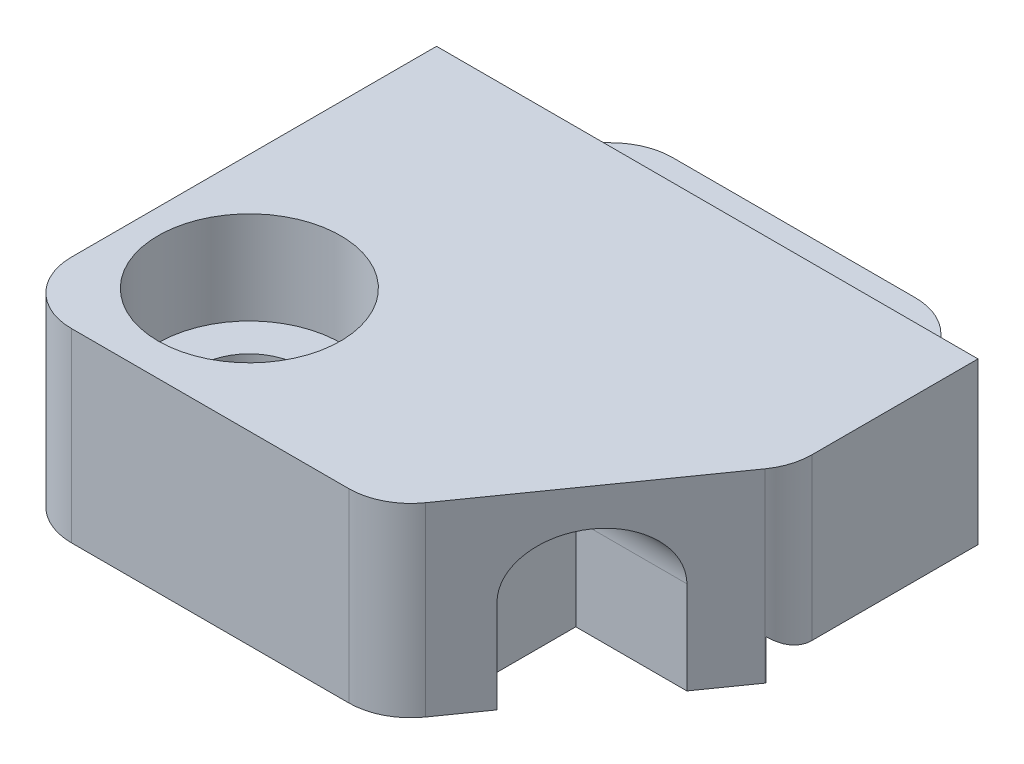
ISO-10303-21;
HEADER;
FILE_DESCRIPTION(('STEP AP214'),'2;1');
FILE_NAME('part.step','',(''),(''),'','','');
FILE_SCHEMA(('AUTOMOTIVE_DESIGN { 1 0 10303 214 1 1 1 1 }'));
ENDSEC;
DATA;
#1=APPLICATION_CONTEXT('core data for automotive mechanical design processes');
#2=APPLICATION_PROTOCOL_DEFINITION('international standard','automotive_design',2000,#1);
#3=PRODUCT_CONTEXT('',#1,'mechanical');
#4=PRODUCT('Part','Part','',(#3));
#5=PRODUCT_RELATED_PRODUCT_CATEGORY('part','',(#4));
#6=PRODUCT_DEFINITION_FORMATION('','',#4);
#7=PRODUCT_DEFINITION_CONTEXT('part definition',#1,'design');
#8=PRODUCT_DEFINITION('design','',#6,#7);
#9=PRODUCT_DEFINITION_SHAPE('','',#8);
#10=(LENGTH_UNIT() NAMED_UNIT(*) SI_UNIT(.MILLI.,.METRE.));
#11=(NAMED_UNIT(*) PLANE_ANGLE_UNIT() SI_UNIT($,.RADIAN.));
#12=(NAMED_UNIT(*) SI_UNIT($,.STERADIAN.) SOLID_ANGLE_UNIT());
#13=UNCERTAINTY_MEASURE_WITH_UNIT(LENGTH_MEASURE(1.E-05),#10,'distance_accuracy_value','');
#14=(GEOMETRIC_REPRESENTATION_CONTEXT(3) GLOBAL_UNCERTAINTY_ASSIGNED_CONTEXT((#13)) GLOBAL_UNIT_ASSIGNED_CONTEXT((#10,
#11,#12)) REPRESENTATION_CONTEXT('',''));
#15=CARTESIAN_POINT('',(0.,0.,0.));
#16=DIRECTION('',(0.,0.,1.));
#17=DIRECTION('',(1.,0.,0.));
#18=AXIS2_PLACEMENT_3D('',#15,#16,#17);
#19=CARTESIAN_POINT('',(8.75000000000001,0.8,-5.99999999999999));
#20=DIRECTION('',(0.,1.,0.));
#21=DIRECTION('',(0.,0.,1.));
#22=AXIS2_PLACEMENT_3D('',#19,#20,#21);
#23=PLANE('',#22);
#24=DIRECTION('',(-1.,0.,0.));
#25=VECTOR('',#24,1.);
#26=CARTESIAN_POINT('',(8.75000000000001,0.8,0.500000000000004));
#27=LINE('',#26,#25);
#28=CARTESIAN_POINT('',(7.14999999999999,0.8,0.499999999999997));
#29=VERTEX_POINT('',#28);
#30=CARTESIAN_POINT('',(6.74999999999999,0.8,0.500000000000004));
#31=VERTEX_POINT('',#30);
#32=EDGE_CURVE('E657',#29,#31,#27,.T.);
#33=ORIENTED_EDGE('',*,*,#32,.T.);
#34=DIRECTION('',(0.,0.,-1.));
#35=VECTOR('',#34,1.);
#36=CARTESIAN_POINT('',(6.74999999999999,0.8,0.499999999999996));
#37=LINE('',#36,#35);
#38=CARTESIAN_POINT('',(6.75,0.8,-6.));
#39=VERTEX_POINT('',#38);
#40=EDGE_CURVE('E560',#31,#39,#37,.T.);
#41=ORIENTED_EDGE('',*,*,#40,.T.);
#42=DIRECTION('',(-1.,0.,0.));
#43=VECTOR('',#42,1.);
#44=CARTESIAN_POINT('',(8.75000000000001,0.8,-5.99999999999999));
#45=LINE('',#44,#43);
#46=CARTESIAN_POINT('',(7.15,0.8,-6.));
#47=VERTEX_POINT('',#46);
#48=EDGE_CURVE('E652',#47,#39,#45,.T.);
#49=ORIENTED_EDGE('',*,*,#48,.F.);
#50=DIRECTION('',(0.,0.,-1.));
#51=VECTOR('',#50,1.);
#52=CARTESIAN_POINT('',(7.14999999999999,0.8,0.499999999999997));
#53=LINE('',#52,#51);
#54=EDGE_CURVE('E490',#29,#47,#53,.T.);
#55=ORIENTED_EDGE('',*,*,#54,.F.);
#56=EDGE_LOOP('',(#33,#41,#49,#55));
#57=FACE_BOUND('',#56,.T.);
#58=ADVANCED_FACE('F35',(#57),#23,.F.);
#59=CARTESIAN_POINT('',(5.15,0.8,-6.00000000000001));
#60=VERTEX_POINT('',#59);
#61=CARTESIAN_POINT('',(4.75000000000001,0.8,-6.00000000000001));
#62=VERTEX_POINT('',#61);
#63=EDGE_CURVE('E877',#60,#62,#45,.T.);
#64=ORIENTED_EDGE('',*,*,#63,.F.);
#65=DIRECTION('',(0.,0.,-1.));
#66=VECTOR('',#65,1.);
#67=CARTESIAN_POINT('',(5.14999999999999,0.8,0.499999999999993));
#68=LINE('',#67,#66);
#69=CARTESIAN_POINT('',(5.14999999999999,0.8,0.499999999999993));
#70=VERTEX_POINT('',#69);
#71=EDGE_CURVE('E568',#70,#60,#68,.T.);
#72=ORIENTED_EDGE('',*,*,#71,.F.);
#73=CARTESIAN_POINT('',(4.74999999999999,0.8,0.500000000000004));
#74=VERTEX_POINT('',#73);
#75=EDGE_CURVE('E907',#70,#74,#27,.T.);
#76=ORIENTED_EDGE('',*,*,#75,.T.);
#77=DIRECTION('',(0.,0.,-1.));
#78=VECTOR('',#77,1.);
#79=CARTESIAN_POINT('',(4.74999999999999,0.8,0.499999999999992));
#80=LINE('',#79,#78);
#81=EDGE_CURVE('E570',#74,#62,#80,.T.);
#82=ORIENTED_EDGE('',*,*,#81,.T.);
#83=EDGE_LOOP('',(#64,#72,#76,#82));
#84=FACE_BOUND('',#83,.T.);
#85=ADVANCED_FACE('F813',(#84),#23,.F.);
#86=CARTESIAN_POINT('',(3.15000000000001,0.8,-6.00000000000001));
#87=VERTEX_POINT('',#86);
#88=CARTESIAN_POINT('',(2.75000000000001,0.8,-6.00000000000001));
#89=VERTEX_POINT('',#88);
#90=EDGE_CURVE('E872',#87,#89,#45,.T.);
#91=ORIENTED_EDGE('',*,*,#90,.F.);
#92=DIRECTION('',(0.,0.,-1.));
#93=VECTOR('',#92,1.);
#94=CARTESIAN_POINT('',(3.14999999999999,0.8,0.499999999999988));
#95=LINE('',#94,#93);
#96=CARTESIAN_POINT('',(3.14999999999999,0.8,0.499999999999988));
#97=VERTEX_POINT('',#96);
#98=EDGE_CURVE('E577',#97,#87,#95,.T.);
#99=ORIENTED_EDGE('',*,*,#98,.F.);
#100=CARTESIAN_POINT('',(2.74999999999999,0.8,0.500000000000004));
#101=VERTEX_POINT('',#100);
#102=EDGE_CURVE('E921',#97,#101,#27,.T.);
#103=ORIENTED_EDGE('',*,*,#102,.T.);
#104=DIRECTION('',(0.,0.,-1.));
#105=VECTOR('',#104,1.);
#106=CARTESIAN_POINT('',(2.74999999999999,0.8,0.499999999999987));
#107=LINE('',#106,#105);
#108=EDGE_CURVE('E579',#101,#89,#107,.T.);
#109=ORIENTED_EDGE('',*,*,#108,.T.);
#110=EDGE_LOOP('',(#91,#99,#103,#109));
#111=FACE_BOUND('',#110,.T.);
#112=ADVANCED_FACE('F820',(#111),#23,.F.);
#113=CARTESIAN_POINT('',(1.15000000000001,0.8,-6.00000000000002));
#114=VERTEX_POINT('',#113);
#115=CARTESIAN_POINT('',(0.75000000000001,0.8,-6.00000000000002));
#116=VERTEX_POINT('',#115);
#117=EDGE_CURVE('E867',#114,#116,#45,.T.);
#118=ORIENTED_EDGE('',*,*,#117,.F.);
#119=DIRECTION('',(0.,0.,-1.));
#120=VECTOR('',#119,1.);
#121=CARTESIAN_POINT('',(1.14999999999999,0.8,0.499999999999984));
#122=LINE('',#121,#120);
#123=CARTESIAN_POINT('',(1.14999999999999,0.8,0.499999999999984));
#124=VERTEX_POINT('',#123);
#125=EDGE_CURVE('E586',#124,#114,#122,.T.);
#126=ORIENTED_EDGE('',*,*,#125,.F.);
#127=CARTESIAN_POINT('',(0.749999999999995,0.8,0.500000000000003));
#128=VERTEX_POINT('',#127);
#129=EDGE_CURVE('E924',#124,#128,#27,.T.);
#130=ORIENTED_EDGE('',*,*,#129,.T.);
#131=DIRECTION('',(0.,0.,-1.));
#132=VECTOR('',#131,1.);
#133=CARTESIAN_POINT('',(0.749999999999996,0.8,0.499999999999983));
#134=LINE('',#133,#132);
#135=EDGE_CURVE('E588',#128,#116,#134,.T.);
#136=ORIENTED_EDGE('',*,*,#135,.T.);
#137=EDGE_LOOP('',(#118,#126,#130,#136));
#138=FACE_BOUND('',#137,.T.);
#139=ADVANCED_FACE('F1284',(#138),#23,.F.);
#140=CARTESIAN_POINT('',(-0.849999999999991,0.8,-6.00000000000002));
#141=VERTEX_POINT('',#140);
#142=CARTESIAN_POINT('',(-1.24999999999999,0.8,-6.00000000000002));
#143=VERTEX_POINT('',#142);
#144=EDGE_CURVE('E862',#141,#143,#45,.T.);
#145=ORIENTED_EDGE('',*,*,#144,.F.);
#146=DIRECTION('',(0.,0.,-1.));
#147=VECTOR('',#146,1.);
#148=CARTESIAN_POINT('',(-0.850000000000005,0.8,0.49999999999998));
#149=LINE('',#148,#147);
#150=CARTESIAN_POINT('',(-0.850000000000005,0.8,0.49999999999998));
#151=VERTEX_POINT('',#150);
#152=EDGE_CURVE('E595',#151,#141,#149,.T.);
#153=ORIENTED_EDGE('',*,*,#152,.F.);
#154=CARTESIAN_POINT('',(-1.25,0.8,0.500000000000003));
#155=VERTEX_POINT('',#154);
#156=EDGE_CURVE('E926',#151,#155,#27,.T.);
#157=ORIENTED_EDGE('',*,*,#156,.T.);
#158=DIRECTION('',(0.,0.,-1.));
#159=VECTOR('',#158,1.);
#160=CARTESIAN_POINT('',(-1.25,0.8,0.499999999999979));
#161=LINE('',#160,#159);
#162=EDGE_CURVE('E597',#155,#143,#161,.T.);
#163=ORIENTED_EDGE('',*,*,#162,.T.);
#164=EDGE_LOOP('',(#145,#153,#157,#163));
#165=FACE_BOUND('',#164,.T.);
#166=ADVANCED_FACE('F849',(#165),#23,.F.);
#167=CARTESIAN_POINT('',(-2.84999999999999,0.8,-6.00000000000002));
#168=VERTEX_POINT('',#167);
#169=CARTESIAN_POINT('',(-3.24999999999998,0.8,-6.00000000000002));
#170=VERTEX_POINT('',#169);
#171=EDGE_CURVE('E860',#168,#170,#45,.T.);
#172=ORIENTED_EDGE('',*,*,#171,.F.);
#173=DIRECTION('',(0.,0.,-1.));
#174=VECTOR('',#173,1.);
#175=CARTESIAN_POINT('',(-2.85,0.8,0.499999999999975));
#176=LINE('',#175,#174);
#177=CARTESIAN_POINT('',(-2.85,0.8,0.499999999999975));
#178=VERTEX_POINT('',#177);
#179=EDGE_CURVE('E604',#178,#168,#176,.T.);
#180=ORIENTED_EDGE('',*,*,#179,.F.);
#181=CARTESIAN_POINT('',(-3.25,0.8,0.500000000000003));
#182=VERTEX_POINT('',#181);
#183=EDGE_CURVE('E931',#178,#182,#27,.T.);
#184=ORIENTED_EDGE('',*,*,#183,.T.);
#185=DIRECTION('',(0.,0.,-1.));
#186=VECTOR('',#185,1.);
#187=CARTESIAN_POINT('',(-3.25,0.8,0.499999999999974));
#188=LINE('',#187,#186);
#189=EDGE_CURVE('E606',#182,#170,#188,.T.);
#190=ORIENTED_EDGE('',*,*,#189,.T.);
#191=EDGE_LOOP('',(#172,#180,#184,#190));
#192=FACE_BOUND('',#191,.T.);
#193=ADVANCED_FACE('F840',(#192),#23,.F.);
#194=CARTESIAN_POINT('',(-4.84999999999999,0.8,-6.00000000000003));
#195=VERTEX_POINT('',#194);
#196=CARTESIAN_POINT('',(-5.24999999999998,0.8,-6.00000000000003));
#197=VERTEX_POINT('',#196);
#198=EDGE_CURVE('E656',#195,#197,#45,.T.);
#199=ORIENTED_EDGE('',*,*,#198,.F.);
#200=DIRECTION('',(0.,0.,-1.));
#201=VECTOR('',#200,1.);
#202=CARTESIAN_POINT('',(-4.85,0.8,0.499999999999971));
#203=LINE('',#202,#201);
#204=CARTESIAN_POINT('',(-4.85,0.8,0.499999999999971));
#205=VERTEX_POINT('',#204);
#206=EDGE_CURVE('E613',#205,#195,#203,.T.);
#207=ORIENTED_EDGE('',*,*,#206,.F.);
#208=CARTESIAN_POINT('',(-5.24999999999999,0.8,0.500000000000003));
#209=VERTEX_POINT('',#208);
#210=EDGE_CURVE('E661',#205,#209,#27,.T.);
#211=ORIENTED_EDGE('',*,*,#210,.T.);
#212=DIRECTION('',(0.,0.,-1.));
#213=VECTOR('',#212,1.);
#214=CARTESIAN_POINT('',(-5.25,0.8,0.49999999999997));
#215=LINE('',#214,#213);
#216=EDGE_CURVE('E615',#209,#197,#215,.T.);
#217=ORIENTED_EDGE('',*,*,#216,.T.);
#218=EDGE_LOOP('',(#199,#207,#211,#217));
#219=FACE_BOUND('',#218,.T.);
#220=ADVANCED_FACE('F829',(#219),#23,.F.);
#221=CARTESIAN_POINT('',(-5.,6.,3.8));
#222=DIRECTION('',(0.,-1.,0.));
#223=DIRECTION('',(0.,0.,-1.));
#224=AXIS2_PLACEMENT_3D('',#221,#222,#223);
#225=CYLINDRICAL_SURFACE('',#224,1.65);
#226=CARTESIAN_POINT('',(-5.,0.,3.8));
#227=DIRECTION('',(0.,1.,0.));
#228=DIRECTION('',(0.,0.,1.));
#229=AXIS2_PLACEMENT_3D('',#226,#227,#228);
#230=CIRCLE('',#229,1.65);
#231=CARTESIAN_POINT('',(-5.,0.,5.45));
#232=VERTEX_POINT('',#231);
#233=EDGE_CURVE('E672',#232,#232,#230,.T.);
#234=ORIENTED_EDGE('',*,*,#233,.F.);
#235=EDGE_LOOP('',(#234));
#236=FACE_BOUND('',#235,.T.);
#237=CARTESIAN_POINT('',(-5.,3.,3.8));
#238=DIRECTION('',(0.,1.,0.));
#239=DIRECTION('',(0.,0.,1.));
#240=AXIS2_PLACEMENT_3D('',#237,#238,#239);
#241=CIRCLE('',#240,1.65);
#242=CARTESIAN_POINT('',(-5.,3.,5.45));
#243=VERTEX_POINT('',#242);
#244=EDGE_CURVE('E669',#243,#243,#241,.T.);
#245=ORIENTED_EDGE('',*,*,#244,.T.);
#246=EDGE_LOOP('',(#245));
#247=FACE_BOUND('',#246,.T.);
#248=ADVANCED_FACE('F839',(#236,#247),#225,.F.);
#249=CARTESIAN_POINT('',(0.,6.,0.));
#250=DIRECTION('',(0.,-1.,0.));
#251=DIRECTION('',(0.,0.,-1.));
#252=AXIS2_PLACEMENT_3D('',#249,#250,#251);
#253=PLANE('',#252);
#254=CARTESIAN_POINT('',(-5.,6.,3.8));
#255=DIRECTION('',(0.,1.,0.));
#256=DIRECTION('',(0.,0.,1.));
#257=AXIS2_PLACEMENT_3D('',#254,#255,#256);
#258=CIRCLE('',#257,2.95);
#259=CARTESIAN_POINT('',(-5.,6.,6.75));
#260=VERTEX_POINT('',#259);
#261=EDGE_CURVE('E665',#260,#260,#258,.T.);
#262=ORIENTED_EDGE('',*,*,#261,.F.);
#263=EDGE_LOOP('',(#262));
#264=FACE_BOUND('',#263,.T.);
#265=DIRECTION('',(0.,0.,-1.));
#266=VECTOR('',#265,1.);
#267=CARTESIAN_POINT('',(8.75,6.,0.));
#268=LINE('',#267,#266);
#269=CARTESIAN_POINT('',(8.75,6.,-0.634221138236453));
#270=VERTEX_POINT('',#269);
#271=CARTESIAN_POINT('',(8.75,6.,-6.));
#272=VERTEX_POINT('',#271);
#273=EDGE_CURVE('E688',#270,#272,#268,.T.);
#274=ORIENTED_EDGE('',*,*,#273,.T.);
#275=DIRECTION('',(-1.,0.,0.));
#276=VECTOR('',#275,1.);
#277=CARTESIAN_POINT('',(-6.75,6.,-6.));
#278=LINE('',#277,#276);
#279=CARTESIAN_POINT('',(-8.75,6.,-6.));
#280=VERTEX_POINT('',#279);
#281=EDGE_CURVE('E676',#272,#280,#278,.T.);
#282=ORIENTED_EDGE('',*,*,#281,.T.);
#283=DIRECTION('',(0.,0.,1.));
#284=VECTOR('',#283,1.);
#285=CARTESIAN_POINT('',(-8.75,6.,-6.));
#286=LINE('',#285,#284);
#287=CARTESIAN_POINT('',(-8.75,6.,5.8));
#288=VERTEX_POINT('',#287);
#289=EDGE_CURVE('E678',#280,#288,#286,.T.);
#290=ORIENTED_EDGE('',*,*,#289,.T.);
#291=CARTESIAN_POINT('',(-6.75,6.,5.8));
#292=DIRECTION('',(0.,-1.,0.));
#293=DIRECTION('',(0.,0.,-1.));
#294=AXIS2_PLACEMENT_3D('',#291,#292,#293);
#295=CIRCLE('',#294,2.);
#296=CARTESIAN_POINT('',(-6.75,6.,7.8));
#297=VERTEX_POINT('',#296);
#298=EDGE_CURVE('E728',#288,#297,#295,.F.);
#299=ORIENTED_EDGE('',*,*,#298,.T.);
#300=DIRECTION('',(1.,0.,0.));
#301=VECTOR('',#300,1.);
#302=CARTESIAN_POINT('',(-8.75,6.,7.8));
#303=LINE('',#302,#301);
#304=CARTESIAN_POINT('',(2.21304919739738,6.,7.8));
#305=VERTEX_POINT('',#304);
#306=EDGE_CURVE('E682',#297,#305,#303,.T.);
#307=ORIENTED_EDGE('',*,*,#306,.T.);
#308=CARTESIAN_POINT('',(2.21304919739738,6.,5.8));
#309=DIRECTION('',(0.,-1.,0.));
#310=DIRECTION('',(0.,0.,-1.));
#311=AXIS2_PLACEMENT_3D('',#308,#309,#310);
#312=CIRCLE('',#311,2.);
#313=CARTESIAN_POINT('',(3.84756546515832,6.,6.95254352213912));
#314=VERTEX_POINT('',#313);
#315=EDGE_CURVE('E730',#305,#314,#312,.F.);
#316=ORIENTED_EDGE('',*,*,#315,.T.);
#317=DIRECTION('',(0.576271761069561,0.,-0.817258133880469));
#318=VECTOR('',#317,1.);
#319=CARTESIAN_POINT('',(3.25,6.,7.8));
#320=LINE('',#319,#318);
#321=CARTESIAN_POINT('',(8.38451626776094,6.,0.51832238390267));
#322=VERTEX_POINT('',#321);
#323=EDGE_CURVE('E685',#314,#322,#320,.T.);
#324=ORIENTED_EDGE('',*,*,#323,.T.);
#325=CARTESIAN_POINT('',(6.75,6.,-0.634221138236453));
#326=DIRECTION('',(0.,-1.,0.));
#327=DIRECTION('',(0.,0.,-1.));
#328=AXIS2_PLACEMENT_3D('',#325,#326,#327);
#329=CIRCLE('',#328,2.);
#330=EDGE_CURVE('E732',#322,#270,#329,.F.);
#331=ORIENTED_EDGE('',*,*,#330,.T.);
#332=EDGE_LOOP('',(#274,#282,#290,#299,#307,#316,#324,#331));
#333=FACE_BOUND('',#332,.T.);
#334=ADVANCED_FACE('F846',(#264,#333),#253,.F.);
#335=CARTESIAN_POINT('',(0.,0.,0.));
#336=DIRECTION('',(0.,-1.,0.));
#337=DIRECTION('',(0.,0.,-1.));
#338=AXIS2_PLACEMENT_3D('',#335,#336,#337);
#339=PLANE('',#338);
#340=DIRECTION('',(1.,0.,0.));
#341=VECTOR('',#340,1.);
#342=CARTESIAN_POINT('',(3.75,0.,2.));
#343=LINE('',#342,#341);
#344=CARTESIAN_POINT('',(3.75,0.,2.));
#345=VERTEX_POINT('',#344);
#346=CARTESIAN_POINT('',(7.33974358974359,0.,2.));
#347=VERTEX_POINT('',#346);
#348=EDGE_CURVE('E416',#345,#347,#343,.T.);
#349=ORIENTED_EDGE('',*,*,#348,.F.);
#350=DIRECTION('',(0.,0.,-1.));
#351=VECTOR('',#350,1.);
#352=CARTESIAN_POINT('',(3.75,0.,2.));
#353=LINE('',#352,#351);
#354=CARTESIAN_POINT('',(3.75,0.,5.6));
#355=VERTEX_POINT('',#354);
#356=EDGE_CURVE('E405',#355,#345,#353,.T.);
#357=ORIENTED_EDGE('',*,*,#356,.F.);
#358=DIRECTION('',(1.,0.,0.));
#359=VECTOR('',#358,1.);
#360=CARTESIAN_POINT('',(3.75,0.,5.6));
#361=LINE('',#360,#359);
#362=CARTESIAN_POINT('',(4.80128205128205,0.,5.6));
#363=VERTEX_POINT('',#362);
#364=EDGE_CURVE('E396',#355,#363,#361,.T.);
#365=ORIENTED_EDGE('',*,*,#364,.T.);
#366=DIRECTION('',(0.576271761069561,0.,-0.817258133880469));
#367=VECTOR('',#366,1.);
#368=CARTESIAN_POINT('',(3.25,0.,7.8));
#369=LINE('',#368,#367);
#370=CARTESIAN_POINT('',(3.84756546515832,0.,6.95254352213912));
#371=VERTEX_POINT('',#370);
#372=EDGE_CURVE('E679',#371,#363,#369,.T.);
#373=ORIENTED_EDGE('',*,*,#372,.F.);
#374=CARTESIAN_POINT('',(2.21304919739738,0.,5.8));
#375=DIRECTION('',(0.,-1.,0.));
#376=DIRECTION('',(0.,0.,-1.));
#377=AXIS2_PLACEMENT_3D('',#374,#375,#376);
#378=CIRCLE('',#377,2.);
#379=CARTESIAN_POINT('',(2.21304919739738,0.,7.8));
#380=VERTEX_POINT('',#379);
#381=EDGE_CURVE('E718',#371,#380,#378,.T.);
#382=ORIENTED_EDGE('',*,*,#381,.T.);
#383=DIRECTION('',(1.,0.,0.));
#384=VECTOR('',#383,1.);
#385=CARTESIAN_POINT('',(-8.75,0.,7.8));
#386=LINE('',#385,#384);
#387=CARTESIAN_POINT('',(-6.75,0.,7.8));
#388=VERTEX_POINT('',#387);
#389=EDGE_CURVE('E693',#388,#380,#386,.T.);
#390=ORIENTED_EDGE('',*,*,#389,.F.);
#391=CARTESIAN_POINT('',(-6.75,0.,5.8));
#392=DIRECTION('',(0.,-1.,0.));
#393=DIRECTION('',(0.,0.,-1.));
#394=AXIS2_PLACEMENT_3D('',#391,#392,#393);
#395=CIRCLE('',#394,2.);
#396=CARTESIAN_POINT('',(-8.75,0.,5.8));
#397=VERTEX_POINT('',#396);
#398=EDGE_CURVE('E715',#388,#397,#395,.T.);
#399=ORIENTED_EDGE('',*,*,#398,.T.);
#400=DIRECTION('',(0.,0.,1.));
#401=VECTOR('',#400,1.);
#402=CARTESIAN_POINT('',(-8.75,0.,-6.));
#403=LINE('',#402,#401);
#404=CARTESIAN_POINT('',(-8.75,0.,0.500000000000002));
#405=VERTEX_POINT('',#404);
#406=EDGE_CURVE('E675',#405,#397,#403,.T.);
#407=ORIENTED_EDGE('',*,*,#406,.F.);
#408=DIRECTION('',(-1.,0.,0.));
#409=VECTOR('',#408,1.);
#410=CARTESIAN_POINT('',(8.75000000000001,0.,0.500000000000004));
#411=LINE('',#410,#409);
#412=CARTESIAN_POINT('',(8.39728334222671,0.,0.500000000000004));
#413=VERTEX_POINT('',#412);
#414=EDGE_CURVE('E646',#413,#405,#411,.T.);
#415=ORIENTED_EDGE('',*,*,#414,.F.);
#416=CARTESIAN_POINT('',(6.75,0.,-0.634221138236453));
#417=DIRECTION('',(0.,-1.,0.));
#418=DIRECTION('',(0.,0.,-1.));
#419=AXIS2_PLACEMENT_3D('',#416,#417,#418);
#420=CIRCLE('',#419,2.);
#421=CARTESIAN_POINT('',(8.38451626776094,0.,0.51832238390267));
#422=VERTEX_POINT('',#421);
#423=EDGE_CURVE('E720',#413,#422,#420,.T.);
#424=ORIENTED_EDGE('',*,*,#423,.T.);
#425=EDGE_CURVE('E696',#347,#422,#369,.T.);
#426=ORIENTED_EDGE('',*,*,#425,.F.);
#427=EDGE_LOOP('',(#349,#357,#365,#373,#382,#390,#399,#407,#415,#424,#426));
#428=FACE_BOUND('',#427,.T.);
#429=ORIENTED_EDGE('',*,*,#233,.T.);
#430=EDGE_LOOP('',(#429));
#431=FACE_BOUND('',#430,.T.);
#432=ADVANCED_FACE('F798',(#428,#431),#339,.T.);
#433=CARTESIAN_POINT('',(-8.75,6.,-6.));
#434=DIRECTION('',(1.,0.,0.));
#435=DIRECTION('',(0.,0.,-1.));
#436=AXIS2_PLACEMENT_3D('',#433,#434,#435);
#437=PLANE('',#436);
#438=DIRECTION('',(0.,-1.,0.));
#439=VECTOR('',#438,1.);
#440=CARTESIAN_POINT('',(-8.75,6.,-6.));
#441=LINE('',#440,#439);
#442=CARTESIAN_POINT('',(-8.75,0.939999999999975,-6.00000000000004));
#443=VERTEX_POINT('',#442);
#444=EDGE_CURVE('E704',#280,#443,#441,.T.);
#445=ORIENTED_EDGE('',*,*,#444,.T.);
#446=DIRECTION('',(0.,0.,1.));
#447=VECTOR('',#446,1.);
#448=CARTESIAN_POINT('',(-8.75,0.939999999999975,-5.99999999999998));
#449=LINE('',#448,#447);
#450=CARTESIAN_POINT('',(-8.75,0.939999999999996,0.499999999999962));
#451=VERTEX_POINT('',#450);
#452=EDGE_CURVE('E639',#443,#451,#449,.T.);
#453=ORIENTED_EDGE('',*,*,#452,.T.);
#454=DIRECTION('',(0.,1.,0.));
#455=VECTOR('',#454,1.);
#456=CARTESIAN_POINT('',(-8.75,0.,0.500000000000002));
#457=LINE('',#456,#455);
#458=EDGE_CURVE('E642',#405,#451,#457,.T.);
#459=ORIENTED_EDGE('',*,*,#458,.F.);
#460=ORIENTED_EDGE('',*,*,#406,.T.);
#461=DIRECTION('',(0.,-1.,0.));
#462=VECTOR('',#461,1.);
#463=CARTESIAN_POINT('',(-8.75,6.,5.8));
#464=LINE('',#463,#462);
#465=EDGE_CURVE('E739',#397,#288,#464,.F.);
#466=ORIENTED_EDGE('',*,*,#465,.T.);
#467=ORIENTED_EDGE('',*,*,#289,.F.);
#468=EDGE_LOOP('',(#445,#453,#459,#460,#466,#467));
#469=FACE_BOUND('',#468,.T.);
#470=ADVANCED_FACE('F964',(#469),#437,.F.);
#471=CARTESIAN_POINT('',(-8.75,6.,7.8));
#472=DIRECTION('',(0.,0.,-1.));
#473=DIRECTION('',(-1.,0.,0.));
#474=AXIS2_PLACEMENT_3D('',#471,#472,#473);
#475=PLANE('',#474);
#476=ORIENTED_EDGE('',*,*,#389,.T.);
#477=DIRECTION('',(0.,-1.,0.));
#478=VECTOR('',#477,1.);
#479=CARTESIAN_POINT('',(2.21304919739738,6.,7.8));
#480=LINE('',#479,#478);
#481=EDGE_CURVE('E737',#380,#305,#480,.F.);
#482=ORIENTED_EDGE('',*,*,#481,.T.);
#483=ORIENTED_EDGE('',*,*,#306,.F.);
#484=DIRECTION('',(0.,-1.,0.));
#485=VECTOR('',#484,1.);
#486=CARTESIAN_POINT('',(-6.75,6.,7.8));
#487=LINE('',#486,#485);
#488=EDGE_CURVE('E734',#297,#388,#487,.T.);
#489=ORIENTED_EDGE('',*,*,#488,.T.);
#490=EDGE_LOOP('',(#476,#482,#483,#489));
#491=FACE_BOUND('',#490,.T.);
#492=ADVANCED_FACE('F975',(#491),#475,.F.);
#493=CARTESIAN_POINT('',(3.25,6.,7.8));
#494=DIRECTION('',(-0.817258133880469,0.,-0.576271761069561));
#495=DIRECTION('',(-0.576271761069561,0.,0.817258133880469));
#496=AXIS2_PLACEMENT_3D('',#493,#494,#495);
#497=PLANE('',#496);
#498=CARTESIAN_POINT('',(6.07051282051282,3.,3.8));
#499=DIRECTION('',(-0.817258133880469,0.,-0.576271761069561));
#500=DIRECTION('',(0.576271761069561,0.,-0.817258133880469));
#501=AXIS2_PLACEMENT_3D('',#498,#499,#500);
#502=ELLIPSE('',#501,2.20248649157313,1.8);
#503=CARTESIAN_POINT('',(4.80128205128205,3.,5.6));
#504=VERTEX_POINT('',#503);
#505=CARTESIAN_POINT('',(7.33974358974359,3.,2.));
#506=VERTEX_POINT('',#505);
#507=EDGE_CURVE('E43',#504,#506,#502,.T.);
#508=ORIENTED_EDGE('',*,*,#507,.T.);
#509=DIRECTION('',(0.,-1.,0.));
#510=VECTOR('',#509,1.);
#511=CARTESIAN_POINT('',(7.33974358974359,6.,2.));
#512=LINE('',#511,#510);
#513=EDGE_CURVE('E11',#506,#347,#512,.T.);
#514=ORIENTED_EDGE('',*,*,#513,.T.);
#515=ORIENTED_EDGE('',*,*,#425,.T.);
#516=DIRECTION('',(0.,-1.,0.));
#517=VECTOR('',#516,1.);
#518=CARTESIAN_POINT('',(8.38451626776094,6.,0.518322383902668));
#519=LINE('',#518,#517);
#520=EDGE_CURVE('E726',#422,#322,#519,.F.);
#521=ORIENTED_EDGE('',*,*,#520,.T.);
#522=ORIENTED_EDGE('',*,*,#323,.F.);
#523=DIRECTION('',(0.,-1.,0.));
#524=VECTOR('',#523,1.);
#525=CARTESIAN_POINT('',(3.84756546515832,6.,6.95254352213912));
#526=LINE('',#525,#524);
#527=EDGE_CURVE('E723',#314,#371,#526,.T.);
#528=ORIENTED_EDGE('',*,*,#527,.T.);
#529=ORIENTED_EDGE('',*,*,#372,.T.);
#530=DIRECTION('',(0.,1.,0.));
#531=VECTOR('',#530,1.);
#532=CARTESIAN_POINT('',(4.80128205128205,6.,5.6));
#533=LINE('',#532,#531);
#534=EDGE_CURVE('E791',#363,#504,#533,.T.);
#535=ORIENTED_EDGE('',*,*,#534,.T.);
#536=EDGE_LOOP('',(#508,#514,#515,#521,#522,#528,#529,#535));
#537=FACE_BOUND('',#536,.T.);
#538=ADVANCED_FACE('F793',(#537),#497,.F.);
#539=CARTESIAN_POINT('',(8.75,6.,0.));
#540=DIRECTION('',(-1.,0.,0.));
#541=DIRECTION('',(0.,0.,1.));
#542=AXIS2_PLACEMENT_3D('',#539,#540,#541);
#543=PLANE('',#542);
#544=DIRECTION('',(0.,-1.,0.));
#545=VECTOR('',#544,1.);
#546=CARTESIAN_POINT('',(8.75,6.,-0.634221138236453));
#547=LINE('',#546,#545);
#548=CARTESIAN_POINT('',(8.74999999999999,0.8,-0.634221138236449));
#549=VERTEX_POINT('',#548);
#550=EDGE_CURVE('E710',#270,#549,#547,.T.);
#551=ORIENTED_EDGE('',*,*,#550,.T.);
#552=DIRECTION('',(0.,0.,-1.));
#553=VECTOR('',#552,1.);
#554=CARTESIAN_POINT('',(8.75000000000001,0.8,-5.99999999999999));
#555=LINE('',#554,#553);
#556=CARTESIAN_POINT('',(8.75,0.8,-6.));
#557=VERTEX_POINT('',#556);
#558=EDGE_CURVE('E643',#549,#557,#555,.T.);
#559=ORIENTED_EDGE('',*,*,#558,.T.);
#560=DIRECTION('',(0.,-1.,0.));
#561=VECTOR('',#560,1.);
#562=CARTESIAN_POINT('',(8.75,6.,-6.));
#563=LINE('',#562,#561);
#564=EDGE_CURVE('E701',#272,#557,#563,.T.);
#565=ORIENTED_EDGE('',*,*,#564,.F.);
#566=ORIENTED_EDGE('',*,*,#273,.F.);
#567=EDGE_LOOP('',(#551,#559,#565,#566));
#568=FACE_BOUND('',#567,.T.);
#569=ADVANCED_FACE('F992',(#568),#543,.F.);
#570=CARTESIAN_POINT('',(6.75,6.,-6.));
#571=DIRECTION('',(0.,0.,1.));
#572=DIRECTION('',(1.,0.,0.));
#573=AXIS2_PLACEMENT_3D('',#570,#571,#572);
#574=PLANE('',#573);
#575=ORIENTED_EDGE('',*,*,#48,.T.);
#576=DIRECTION('',(0.581238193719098,-0.813733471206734,0.));
#577=VECTOR('',#576,1.);
#578=CARTESIAN_POINT('',(6.25,1.5,-6.));
#579=LINE('',#578,#577);
#580=CARTESIAN_POINT('',(6.25,1.5,-6.));
#581=VERTEX_POINT('',#580);
#582=EDGE_CURVE('E423',#581,#39,#579,.T.);
#583=ORIENTED_EDGE('',*,*,#582,.F.);
#584=DIRECTION('',(1.,0.,0.));
#585=VECTOR('',#584,1.);
#586=CARTESIAN_POINT('',(6.25,1.5,-6.));
#587=LINE('',#586,#585);
#588=CARTESIAN_POINT('',(5.65,1.5,-6.00000000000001));
#589=VERTEX_POINT('',#588);
#590=EDGE_CURVE('E556',#589,#581,#587,.T.);
#591=ORIENTED_EDGE('',*,*,#590,.F.);
#592=DIRECTION('',(0.581238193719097,0.813733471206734,0.));
#593=VECTOR('',#592,1.);
#594=CARTESIAN_POINT('',(5.65,1.5,-6.00000000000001));
#595=LINE('',#594,#593);
#596=EDGE_CURVE('E553',#60,#589,#595,.T.);
#597=ORIENTED_EDGE('',*,*,#596,.F.);
#598=ORIENTED_EDGE('',*,*,#63,.T.);
#599=DIRECTION('',(0.581238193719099,-0.813733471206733,0.));
#600=VECTOR('',#599,1.);
#601=CARTESIAN_POINT('',(4.25,1.5,-6.00000000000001));
#602=LINE('',#601,#600);
#603=CARTESIAN_POINT('',(4.25,1.5,-6.00000000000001));
#604=VERTEX_POINT('',#603);
#605=EDGE_CURVE('E551',#604,#62,#602,.T.);
#606=ORIENTED_EDGE('',*,*,#605,.F.);
#607=DIRECTION('',(1.,0.,0.));
#608=VECTOR('',#607,1.);
#609=CARTESIAN_POINT('',(4.25,1.5,-6.00000000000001));
#610=LINE('',#609,#608);
#611=CARTESIAN_POINT('',(3.65000000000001,1.5,-6.00000000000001));
#612=VERTEX_POINT('',#611);
#613=EDGE_CURVE('E548',#612,#604,#610,.T.);
#614=ORIENTED_EDGE('',*,*,#613,.F.);
#615=DIRECTION('',(0.581238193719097,0.813733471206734,0.));
#616=VECTOR('',#615,1.);
#617=CARTESIAN_POINT('',(3.65000000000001,1.5,-6.00000000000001));
#618=LINE('',#617,#616);
#619=EDGE_CURVE('E545',#87,#612,#618,.T.);
#620=ORIENTED_EDGE('',*,*,#619,.F.);
#621=ORIENTED_EDGE('',*,*,#90,.T.);
#622=DIRECTION('',(0.581238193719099,-0.813733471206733,0.));
#623=VECTOR('',#622,1.);
#624=CARTESIAN_POINT('',(2.25,1.5,-6.00000000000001));
#625=LINE('',#624,#623);
#626=CARTESIAN_POINT('',(2.25,1.5,-6.00000000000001));
#627=VERTEX_POINT('',#626);
#628=EDGE_CURVE('E543',#627,#89,#625,.T.);
#629=ORIENTED_EDGE('',*,*,#628,.F.);
#630=DIRECTION('',(1.,0.,0.));
#631=VECTOR('',#630,1.);
#632=CARTESIAN_POINT('',(2.25,1.5,-6.00000000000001));
#633=LINE('',#632,#631);
#634=CARTESIAN_POINT('',(1.65000000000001,1.5,-6.00000000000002));
#635=VERTEX_POINT('',#634);
#636=EDGE_CURVE('E540',#635,#627,#633,.T.);
#637=ORIENTED_EDGE('',*,*,#636,.F.);
#638=DIRECTION('',(0.581238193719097,0.813733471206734,0.));
#639=VECTOR('',#638,1.);
#640=CARTESIAN_POINT('',(1.65000000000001,1.5,-6.00000000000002));
#641=LINE('',#640,#639);
#642=EDGE_CURVE('E537',#114,#635,#641,.T.);
#643=ORIENTED_EDGE('',*,*,#642,.F.);
#644=ORIENTED_EDGE('',*,*,#117,.T.);
#645=DIRECTION('',(0.5812381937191,-0.813733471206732,0.));
#646=VECTOR('',#645,1.);
#647=CARTESIAN_POINT('',(0.250000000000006,1.5,-6.00000000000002));
#648=LINE('',#647,#646);
#649=CARTESIAN_POINT('',(0.250000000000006,1.5,-6.00000000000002));
#650=VERTEX_POINT('',#649);
#651=EDGE_CURVE('E535',#650,#116,#648,.T.);
#652=ORIENTED_EDGE('',*,*,#651,.F.);
#653=DIRECTION('',(1.,0.,0.));
#654=VECTOR('',#653,1.);
#655=CARTESIAN_POINT('',(0.250000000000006,1.5,-6.00000000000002));
#656=LINE('',#655,#654);
#657=CARTESIAN_POINT('',(-0.34999999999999,1.5,-6.00000000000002));
#658=VERTEX_POINT('',#657);
#659=EDGE_CURVE('E532',#658,#650,#656,.T.);
#660=ORIENTED_EDGE('',*,*,#659,.F.);
#661=DIRECTION('',(0.581238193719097,0.813733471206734,0.));
#662=VECTOR('',#661,1.);
#663=CARTESIAN_POINT('',(-0.34999999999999,1.5,-6.00000000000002));
#664=LINE('',#663,#662);
#665=EDGE_CURVE('E529',#141,#658,#664,.T.);
#666=ORIENTED_EDGE('',*,*,#665,.F.);
#667=ORIENTED_EDGE('',*,*,#144,.T.);
#668=DIRECTION('',(0.5812381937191,-0.813733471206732,0.));
#669=VECTOR('',#668,1.);
#670=CARTESIAN_POINT('',(-1.74999999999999,1.5,-6.00000000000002));
#671=LINE('',#670,#669);
#672=CARTESIAN_POINT('',(-1.74999999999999,1.5,-6.00000000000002));
#673=VERTEX_POINT('',#672);
#674=EDGE_CURVE('E527',#673,#143,#671,.T.);
#675=ORIENTED_EDGE('',*,*,#674,.F.);
#676=DIRECTION('',(1.,0.,0.));
#677=VECTOR('',#676,1.);
#678=CARTESIAN_POINT('',(-1.74999999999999,1.5,-6.00000000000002));
#679=LINE('',#678,#677);
#680=CARTESIAN_POINT('',(-2.34999999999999,1.5,-6.00000000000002));
#681=VERTEX_POINT('',#680);
#682=EDGE_CURVE('E524',#681,#673,#679,.T.);
#683=ORIENTED_EDGE('',*,*,#682,.F.);
#684=DIRECTION('',(0.581238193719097,0.813733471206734,0.));
#685=VECTOR('',#684,1.);
#686=CARTESIAN_POINT('',(-2.34999999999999,1.5,-6.00000000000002));
#687=LINE('',#686,#685);
#688=EDGE_CURVE('E521',#168,#681,#687,.T.);
#689=ORIENTED_EDGE('',*,*,#688,.F.);
#690=ORIENTED_EDGE('',*,*,#171,.T.);
#691=DIRECTION('',(0.581238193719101,-0.813733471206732,0.));
#692=VECTOR('',#691,1.);
#693=CARTESIAN_POINT('',(-3.74999999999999,1.5,-6.00000000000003));
#694=LINE('',#693,#692);
#695=CARTESIAN_POINT('',(-3.74999999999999,1.5,-6.00000000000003));
#696=VERTEX_POINT('',#695);
#697=EDGE_CURVE('E519',#696,#170,#694,.T.);
#698=ORIENTED_EDGE('',*,*,#697,.F.);
#699=DIRECTION('',(1.,0.,0.));
#700=VECTOR('',#699,1.);
#701=CARTESIAN_POINT('',(-3.74999999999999,1.5,-6.00000000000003));
#702=LINE('',#701,#700);
#703=CARTESIAN_POINT('',(-4.34999999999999,1.5,-6.00000000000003));
#704=VERTEX_POINT('',#703);
#705=EDGE_CURVE('E516',#704,#696,#702,.T.);
#706=ORIENTED_EDGE('',*,*,#705,.F.);
#707=DIRECTION('',(0.581238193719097,0.813733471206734,0.));
#708=VECTOR('',#707,1.);
#709=CARTESIAN_POINT('',(-4.34999999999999,1.5,-6.00000000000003));
#710=LINE('',#709,#708);
#711=EDGE_CURVE('E513',#195,#704,#710,.T.);
#712=ORIENTED_EDGE('',*,*,#711,.F.);
#713=ORIENTED_EDGE('',*,*,#198,.T.);
#714=DIRECTION('',(0.581238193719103,-0.81373347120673,0.));
#715=VECTOR('',#714,1.);
#716=CARTESIAN_POINT('',(-5.74999999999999,1.5,-6.00000000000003));
#717=LINE('',#716,#715);
#718=CARTESIAN_POINT('',(-5.74999999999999,1.5,-6.00000000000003));
#719=VERTEX_POINT('',#718);
#720=EDGE_CURVE('E511',#719,#197,#717,.T.);
#721=ORIENTED_EDGE('',*,*,#720,.F.);
#722=DIRECTION('',(1.,0.,0.));
#723=VECTOR('',#722,1.);
#724=CARTESIAN_POINT('',(-5.74999999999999,1.5,-6.00000000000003));
#725=LINE('',#724,#723);
#726=CARTESIAN_POINT('',(-6.34999999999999,1.5,-6.00000000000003));
#727=VERTEX_POINT('',#726);
#728=EDGE_CURVE('E508',#727,#719,#725,.T.);
#729=ORIENTED_EDGE('',*,*,#728,.F.);
#730=DIRECTION('',(0.581238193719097,0.813733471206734,0.));
#731=VECTOR('',#730,1.);
#732=CARTESIAN_POINT('',(-6.34999999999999,1.5,-6.00000000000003));
#733=LINE('',#732,#731);
#734=CARTESIAN_POINT('',(-6.84999999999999,0.8,-6.00000000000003));
#735=VERTEX_POINT('',#734);
#736=EDGE_CURVE('E505',#735,#727,#733,.T.);
#737=ORIENTED_EDGE('',*,*,#736,.F.);
#738=CARTESIAN_POINT('',(-7.24999999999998,0.8,-6.00000000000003));
#739=VERTEX_POINT('',#738);
#740=EDGE_CURVE('E653',#735,#739,#45,.T.);
#741=ORIENTED_EDGE('',*,*,#740,.T.);
#742=DIRECTION('',(0.581238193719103,-0.81373347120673,0.));
#743=VECTOR('',#742,1.);
#744=CARTESIAN_POINT('',(-7.74999999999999,1.5,-6.00000000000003));
#745=LINE('',#744,#743);
#746=CARTESIAN_POINT('',(-7.74999999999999,1.5,-6.00000000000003));
#747=VERTEX_POINT('',#746);
#748=EDGE_CURVE('E503',#747,#739,#745,.T.);
#749=ORIENTED_EDGE('',*,*,#748,.F.);
#750=DIRECTION('',(1.,0.,0.));
#751=VECTOR('',#750,1.);
#752=CARTESIAN_POINT('',(-7.74999999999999,1.5,-6.00000000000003));
#753=LINE('',#752,#751);
#754=CARTESIAN_POINT('',(-8.34999999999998,1.5,-6.00000000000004));
#755=VERTEX_POINT('',#754);
#756=EDGE_CURVE('E500',#755,#747,#753,.T.);
#757=ORIENTED_EDGE('',*,*,#756,.F.);
#758=DIRECTION('',(0.581238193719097,0.813733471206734,0.));
#759=VECTOR('',#758,1.);
#760=CARTESIAN_POINT('',(-8.34999999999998,1.5,-6.00000000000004));
#761=LINE('',#760,#759);
#762=EDGE_CURVE('E498',#443,#755,#761,.T.);
#763=ORIENTED_EDGE('',*,*,#762,.F.);
#764=ORIENTED_EDGE('',*,*,#444,.F.);
#765=ORIENTED_EDGE('',*,*,#281,.F.);
#766=ORIENTED_EDGE('',*,*,#564,.T.);
#767=DIRECTION('',(0.581238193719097,-0.813733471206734,0.));
#768=VECTOR('',#767,1.);
#769=CARTESIAN_POINT('',(8.25,1.5,-6.));
#770=LINE('',#769,#768);
#771=CARTESIAN_POINT('',(8.25,1.5,-6.));
#772=VERTEX_POINT('',#771);
#773=EDGE_CURVE('E496',#772,#557,#770,.T.);
#774=ORIENTED_EDGE('',*,*,#773,.F.);
#775=DIRECTION('',(1.,0.,0.));
#776=VECTOR('',#775,1.);
#777=CARTESIAN_POINT('',(8.25,1.5,-6.));
#778=LINE('',#777,#776);
#779=CARTESIAN_POINT('',(7.65,1.5,-6.));
#780=VERTEX_POINT('',#779);
#781=EDGE_CURVE('E493',#780,#772,#778,.T.);
#782=ORIENTED_EDGE('',*,*,#781,.F.);
#783=DIRECTION('',(0.581238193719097,0.813733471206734,0.));
#784=VECTOR('',#783,1.);
#785=CARTESIAN_POINT('',(7.65,1.5,-6.));
#786=LINE('',#785,#784);
#787=EDGE_CURVE('E415',#47,#780,#786,.T.);
#788=ORIENTED_EDGE('',*,*,#787,.F.);
#789=EDGE_LOOP('',(#575,#583,#591,#597,#598,#606,#614,#620,#621,#629,#637,#643,#644,#652,#660,
#666,#667,#675,#683,#689,#690,#698,#706,#712,#713,#721,#729,#737,#741,#749,#757,#763,#764,#765,
#766,#774,#782,#788));
#790=FACE_BOUND('',#789,.T.);
#791=DIRECTION('',(0.,-1.,0.));
#792=VECTOR('',#791,1.);
#793=CARTESIAN_POINT('',(-6.75,6.,-6.));
#794=LINE('',#793,#792);
#795=CARTESIAN_POINT('',(-6.75,3.9,-6.));
#796=VERTEX_POINT('',#795);
#797=CARTESIAN_POINT('',(-6.75,2.2,-6.));
#798=VERTEX_POINT('',#797);
#799=EDGE_CURVE('E707',#796,#798,#794,.T.);
#800=ORIENTED_EDGE('',*,*,#799,.T.);
#801=DIRECTION('',(-1.,0.,0.));
#802=VECTOR('',#801,1.);
#803=CARTESIAN_POINT('',(8.75000000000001,2.2,-6.));
#804=LINE('',#803,#802);
#805=CARTESIAN_POINT('',(6.75,2.2,-6.));
#806=VERTEX_POINT('',#805);
#807=EDGE_CURVE('E648',#806,#798,#804,.T.);
#808=ORIENTED_EDGE('',*,*,#807,.F.);
#809=DIRECTION('',(0.,-1.,0.));
#810=VECTOR('',#809,1.);
#811=CARTESIAN_POINT('',(6.75,6.,-6.));
#812=LINE('',#811,#810);
#813=CARTESIAN_POINT('',(6.75,3.9,-6.));
#814=VERTEX_POINT('',#813);
#815=EDGE_CURVE('E691',#814,#806,#812,.T.);
#816=ORIENTED_EDGE('',*,*,#815,.F.);
#817=DIRECTION('',(-1.,0.,0.));
#818=VECTOR('',#817,1.);
#819=CARTESIAN_POINT('',(8.75000000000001,3.9,-6.));
#820=LINE('',#819,#818);
#821=EDGE_CURVE('E651',#814,#796,#820,.T.);
#822=ORIENTED_EDGE('',*,*,#821,.T.);
#823=EDGE_LOOP('',(#800,#808,#816,#822));
#824=FACE_BOUND('',#823,.T.);
#825=ADVANCED_FACE('F889',(#790,#824),#574,.F.);
#826=CARTESIAN_POINT('',(6.75,6.,-8.8));
#827=DIRECTION('',(0.,0.,1.));
#828=DIRECTION('',(1.,0.,0.));
#829=AXIS2_PLACEMENT_3D('',#826,#827,#828);
#830=PLANE('',#829);
#831=DIRECTION('',(1.,0.,0.));
#832=VECTOR('',#831,1.);
#833=CARTESIAN_POINT('',(6.75,3.9,-8.8));
#834=LINE('',#833,#832);
#835=CARTESIAN_POINT('',(-3.92157287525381,3.9,-8.8));
#836=VERTEX_POINT('',#835);
#837=CARTESIAN_POINT('',(3.92157287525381,3.9,-8.8));
#838=VERTEX_POINT('',#837);
#839=EDGE_CURVE('E741',#836,#838,#834,.T.);
#840=ORIENTED_EDGE('',*,*,#839,.T.);
#841=DIRECTION('',(0.,1.,0.));
#842=VECTOR('',#841,1.);
#843=CARTESIAN_POINT('',(3.92157287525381,2.2,-8.8));
#844=LINE('',#843,#842);
#845=CARTESIAN_POINT('',(3.92157287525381,2.2,-8.8));
#846=VERTEX_POINT('',#845);
#847=EDGE_CURVE('E784',#838,#846,#844,.F.);
#848=ORIENTED_EDGE('',*,*,#847,.T.);
#849=DIRECTION('',(-1.,0.,0.));
#850=VECTOR('',#849,1.);
#851=CARTESIAN_POINT('',(6.75,2.2,-8.8));
#852=LINE('',#851,#850);
#853=CARTESIAN_POINT('',(-3.92157287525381,2.2,-8.8));
#854=VERTEX_POINT('',#853);
#855=EDGE_CURVE('E746',#846,#854,#852,.T.);
#856=ORIENTED_EDGE('',*,*,#855,.T.);
#857=DIRECTION('',(0.,-1.,0.));
#858=VECTOR('',#857,1.);
#859=CARTESIAN_POINT('',(-3.92157287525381,3.9,-8.8));
#860=LINE('',#859,#858);
#861=EDGE_CURVE('E781',#854,#836,#860,.F.);
#862=ORIENTED_EDGE('',*,*,#861,.T.);
#863=EDGE_LOOP('',(#840,#848,#856,#862));
#864=FACE_BOUND('',#863,.T.);
#865=ADVANCED_FACE('F1180',(#864),#830,.F.);
#866=CARTESIAN_POINT('',(-5.,3.,3.8));
#867=DIRECTION('',(0.,1.,0.));
#868=DIRECTION('',(0.,0.,1.));
#869=AXIS2_PLACEMENT_3D('',#866,#867,#868);
#870=CYLINDRICAL_SURFACE('',#869,2.95);
#871=CARTESIAN_POINT('',(-5.,3.,3.8));
#872=DIRECTION('',(0.,1.,0.));
#873=DIRECTION('',(0.,0.,1.));
#874=AXIS2_PLACEMENT_3D('',#871,#872,#873);
#875=CIRCLE('',#874,2.95);
#876=CARTESIAN_POINT('',(-5.,3.,6.75));
#877=VERTEX_POINT('',#876);
#878=EDGE_CURVE('E666',#877,#877,#875,.T.);
#879=ORIENTED_EDGE('',*,*,#878,.F.);
#880=EDGE_LOOP('',(#879));
#881=FACE_BOUND('',#880,.T.);
#882=ORIENTED_EDGE('',*,*,#261,.T.);
#883=EDGE_LOOP('',(#882));
#884=FACE_BOUND('',#883,.T.);
#885=ADVANCED_FACE('F1185',(#881,#884),#870,.F.);
#886=CARTESIAN_POINT('',(-5.,3.,3.8));
#887=DIRECTION('',(0.,1.,0.));
#888=DIRECTION('',(0.,0.,1.));
#889=AXIS2_PLACEMENT_3D('',#886,#887,#888);
#890=PLANE('',#889);
#891=ORIENTED_EDGE('',*,*,#244,.F.);
#892=EDGE_LOOP('',(#891));
#893=FACE_BOUND('',#892,.T.);
#894=ORIENTED_EDGE('',*,*,#878,.T.);
#895=EDGE_LOOP('',(#894));
#896=FACE_BOUND('',#895,.T.);
#897=ADVANCED_FACE('F1150',(#893,#896),#890,.T.);
#898=CARTESIAN_POINT('',(6.75,6.,-0.634221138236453));
#899=DIRECTION('',(0.,-1.,0.));
#900=DIRECTION('',(0.,0.,-1.));
#901=AXIS2_PLACEMENT_3D('',#898,#899,#900);
#902=CYLINDRICAL_SURFACE('',#901,2.);
#903=CARTESIAN_POINT('',(6.75,3.59999999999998,-0.634221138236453));
#904=DIRECTION('',(0.813733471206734,0.581238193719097,0.));
#905=DIRECTION('',(0.581238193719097,-0.813733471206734,0.));
#906=AXIS2_PLACEMENT_3D('',#903,#904,#905);
#907=ELLIPSE('',#906,3.44093010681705,2.);
#908=CARTESIAN_POINT('',(8.39728334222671,1.29380332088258,0.5));
#909=VERTEX_POINT('',#908);
#910=EDGE_CURVE('E563',#549,#909,#907,.F.);
#911=ORIENTED_EDGE('',*,*,#910,.F.);
#912=ORIENTED_EDGE('',*,*,#550,.F.);
#913=ORIENTED_EDGE('',*,*,#330,.F.);
#914=ORIENTED_EDGE('',*,*,#520,.F.);
#915=ORIENTED_EDGE('',*,*,#423,.F.);
#916=DIRECTION('',(0.,-1.,0.));
#917=VECTOR('',#916,1.);
#918=CARTESIAN_POINT('',(8.39728334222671,6.,0.500000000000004));
#919=LINE('',#918,#917);
#920=EDGE_CURVE('E744',#909,#413,#919,.T.);
#921=ORIENTED_EDGE('',*,*,#920,.F.);
#922=EDGE_LOOP('',(#911,#912,#913,#914,#915,#921));
#923=FACE_BOUND('',#922,.T.);
#924=ADVANCED_FACE('F989',(#923),#902,.T.);
#925=CARTESIAN_POINT('',(2.21304919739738,6.,5.8));
#926=DIRECTION('',(0.,-1.,0.));
#927=DIRECTION('',(0.,0.,-1.));
#928=AXIS2_PLACEMENT_3D('',#925,#926,#927);
#929=CYLINDRICAL_SURFACE('',#928,2.);
#930=ORIENTED_EDGE('',*,*,#315,.F.);
#931=ORIENTED_EDGE('',*,*,#481,.F.);
#932=ORIENTED_EDGE('',*,*,#381,.F.);
#933=ORIENTED_EDGE('',*,*,#527,.F.);
#934=EDGE_LOOP('',(#930,#931,#932,#933));
#935=FACE_BOUND('',#934,.T.);
#936=ADVANCED_FACE('F981',(#935),#929,.T.);
#937=CARTESIAN_POINT('',(-6.75,6.,5.8));
#938=DIRECTION('',(0.,-1.,0.));
#939=DIRECTION('',(0.,0.,-1.));
#940=AXIS2_PLACEMENT_3D('',#937,#938,#939);
#941=CYLINDRICAL_SURFACE('',#940,2.);
#942=ORIENTED_EDGE('',*,*,#298,.F.);
#943=ORIENTED_EDGE('',*,*,#465,.F.);
#944=ORIENTED_EDGE('',*,*,#398,.F.);
#945=ORIENTED_EDGE('',*,*,#488,.F.);
#946=EDGE_LOOP('',(#942,#943,#944,#945));
#947=FACE_BOUND('',#946,.T.);
#948=ADVANCED_FACE('F972',(#947),#941,.T.);
#949=CARTESIAN_POINT('',(8.75000000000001,3.9,-8.8));
#950=DIRECTION('',(0.,-1.,0.));
#951=DIRECTION('',(0.,0.,-1.));
#952=AXIS2_PLACEMENT_3D('',#949,#950,#951);
#953=PLANE('',#952);
#954=ORIENTED_EDGE('',*,*,#821,.F.);
#955=CARTESIAN_POINT('',(4.75020495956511,3.9,-5.9713679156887));
#956=DIRECTION('',(0.,-1.,0.));
#957=DIRECTION('',(0.,0.,-1.));
#958=AXIS2_PLACEMENT_3D('',#955,#956,#957);
#959=CIRCLE('',#958,2.);
#960=CARTESIAN_POINT('',(6.16441852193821,3.9,-7.3855814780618));
#961=VERTEX_POINT('',#960);
#962=EDGE_CURVE('E767',#814,#961,#959,.F.);
#963=ORIENTED_EDGE('',*,*,#962,.T.);
#964=DIRECTION('',(0.707106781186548,0.,0.707106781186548));
#965=VECTOR('',#964,1.);
#966=CARTESIAN_POINT('',(4.75,3.9,-8.8));
#967=LINE('',#966,#965);
#968=CARTESIAN_POINT('',(5.3357864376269,3.9,-8.2142135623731));
#969=VERTEX_POINT('',#968);
#970=EDGE_CURVE('E758',#961,#969,#967,.F.);
#971=ORIENTED_EDGE('',*,*,#970,.T.);
#972=CARTESIAN_POINT('',(3.92157287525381,3.9,-6.8));
#973=DIRECTION('',(0.,-1.,0.));
#974=DIRECTION('',(0.,0.,-1.));
#975=AXIS2_PLACEMENT_3D('',#972,#973,#974);
#976=CIRCLE('',#975,2.);
#977=EDGE_CURVE('E765',#969,#838,#976,.F.);
#978=ORIENTED_EDGE('',*,*,#977,.T.);
#979=ORIENTED_EDGE('',*,*,#839,.F.);
#980=CARTESIAN_POINT('',(-3.92157287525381,3.9,-6.8));
#981=DIRECTION('',(0.,-1.,0.));
#982=DIRECTION('',(0.,0.,-1.));
#983=AXIS2_PLACEMENT_3D('',#980,#981,#982);
#984=CIRCLE('',#983,2.);
#985=CARTESIAN_POINT('',(-5.3357864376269,3.9,-8.2142135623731));
#986=VERTEX_POINT('',#985);
#987=EDGE_CURVE('E763',#836,#986,#984,.F.);
#988=ORIENTED_EDGE('',*,*,#987,.T.);
#989=DIRECTION('',(0.707106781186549,0.,-0.707106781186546));
#990=VECTOR('',#989,1.);
#991=CARTESIAN_POINT('',(-6.75,3.9,-6.8));
#992=LINE('',#991,#990);
#993=CARTESIAN_POINT('',(-6.1644185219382,3.9,-7.3855814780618));
#994=VERTEX_POINT('',#993);
#995=EDGE_CURVE('E755',#986,#994,#992,.F.);
#996=ORIENTED_EDGE('',*,*,#995,.T.);
#997=CARTESIAN_POINT('',(-4.75020495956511,3.9,-5.9713679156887));
#998=DIRECTION('',(0.,-1.,0.));
#999=DIRECTION('',(0.,0.,-1.));
#1000=AXIS2_PLACEMENT_3D('',#997,#998,#999);
#1001=CIRCLE('',#1000,2.);
#1002=EDGE_CURVE('E761',#994,#796,#1001,.F.);
#1003=ORIENTED_EDGE('',*,*,#1002,.T.);
#1004=EDGE_LOOP('',(#954,#963,#971,#978,#979,#988,#996,#1003));
#1005=FACE_BOUND('',#1004,.T.);
#1006=ADVANCED_FACE('F835',(#1005),#953,.F.);
#1007=CARTESIAN_POINT('',(8.75000000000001,2.2,-8.8));
#1008=DIRECTION('',(0.,1.,0.));
#1009=DIRECTION('',(0.,0.,1.));
#1010=AXIS2_PLACEMENT_3D('',#1007,#1008,#1009);
#1011=PLANE('',#1010);
#1012=DIRECTION('',(-0.707106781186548,0.,-0.707106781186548));
#1013=VECTOR('',#1012,1.);
#1014=CARTESIAN_POINT('',(4.75,2.2,-8.8));
#1015=LINE('',#1014,#1013);
#1016=CARTESIAN_POINT('',(5.3357864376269,2.2,-8.2142135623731));
#1017=VERTEX_POINT('',#1016);
#1018=CARTESIAN_POINT('',(6.16441852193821,2.2,-7.3855814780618));
#1019=VERTEX_POINT('',#1018);
#1020=EDGE_CURVE('E752',#1017,#1019,#1015,.F.);
#1021=ORIENTED_EDGE('',*,*,#1020,.T.);
#1022=CARTESIAN_POINT('',(4.75020495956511,2.2,-5.9713679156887));
#1023=DIRECTION('',(0.,1.,0.));
#1024=DIRECTION('',(0.,0.,1.));
#1025=AXIS2_PLACEMENT_3D('',#1022,#1023,#1024);
#1026=CIRCLE('',#1025,2.);
#1027=EDGE_CURVE('E779',#1019,#806,#1026,.F.);
#1028=ORIENTED_EDGE('',*,*,#1027,.T.);
#1029=ORIENTED_EDGE('',*,*,#807,.T.);
#1030=CARTESIAN_POINT('',(-4.75020495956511,2.2,-5.9713679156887));
#1031=DIRECTION('',(0.,1.,0.));
#1032=DIRECTION('',(0.,0.,1.));
#1033=AXIS2_PLACEMENT_3D('',#1030,#1031,#1032);
#1034=CIRCLE('',#1033,2.);
#1035=CARTESIAN_POINT('',(-6.1644185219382,2.2,-7.3855814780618));
#1036=VERTEX_POINT('',#1035);
#1037=EDGE_CURVE('E773',#798,#1036,#1034,.F.);
#1038=ORIENTED_EDGE('',*,*,#1037,.T.);
#1039=DIRECTION('',(-0.707106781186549,0.,0.707106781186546));
#1040=VECTOR('',#1039,1.);
#1041=CARTESIAN_POINT('',(-6.75,2.2,-6.8));
#1042=LINE('',#1041,#1040);
#1043=CARTESIAN_POINT('',(-5.3357864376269,2.2,-8.2142135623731));
#1044=VERTEX_POINT('',#1043);
#1045=EDGE_CURVE('E749',#1036,#1044,#1042,.F.);
#1046=ORIENTED_EDGE('',*,*,#1045,.T.);
#1047=CARTESIAN_POINT('',(-3.92157287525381,2.2,-6.8));
#1048=DIRECTION('',(0.,1.,0.));
#1049=DIRECTION('',(0.,0.,1.));
#1050=AXIS2_PLACEMENT_3D('',#1047,#1048,#1049);
#1051=CIRCLE('',#1050,2.);
#1052=EDGE_CURVE('E775',#1044,#854,#1051,.F.);
#1053=ORIENTED_EDGE('',*,*,#1052,.T.);
#1054=ORIENTED_EDGE('',*,*,#855,.F.);
#1055=CARTESIAN_POINT('',(3.92157287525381,2.2,-6.8));
#1056=DIRECTION('',(0.,1.,0.));
#1057=DIRECTION('',(0.,0.,1.));
#1058=AXIS2_PLACEMENT_3D('',#1055,#1056,#1057);
#1059=CIRCLE('',#1058,2.);
#1060=EDGE_CURVE('E777',#846,#1017,#1059,.F.);
#1061=ORIENTED_EDGE('',*,*,#1060,.T.);
#1062=EDGE_LOOP('',(#1021,#1028,#1029,#1038,#1046,#1053,#1054,#1061));
#1063=FACE_BOUND('',#1062,.T.);
#1064=ADVANCED_FACE('F827',(#1063),#1011,.F.);
#1065=ORIENTED_EDGE('',*,*,#740,.F.);
#1066=DIRECTION('',(0.,0.,-1.));
#1067=VECTOR('',#1066,1.);
#1068=CARTESIAN_POINT('',(-6.85,0.8,0.499999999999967));
#1069=LINE('',#1068,#1067);
#1070=CARTESIAN_POINT('',(-6.85,0.8,0.499999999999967));
#1071=VERTEX_POINT('',#1070);
#1072=EDGE_CURVE('E622',#1071,#735,#1069,.T.);
#1073=ORIENTED_EDGE('',*,*,#1072,.F.);
#1074=CARTESIAN_POINT('',(-7.24999999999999,0.8,0.500000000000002));
#1075=VERTEX_POINT('',#1074);
#1076=EDGE_CURVE('E658',#1071,#1075,#27,.T.);
#1077=ORIENTED_EDGE('',*,*,#1076,.T.);
#1078=DIRECTION('',(0.,0.,-1.));
#1079=VECTOR('',#1078,1.);
#1080=CARTESIAN_POINT('',(-7.24999999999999,0.8,0.499999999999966));
#1081=LINE('',#1080,#1079);
#1082=EDGE_CURVE('E624',#1075,#739,#1081,.T.);
#1083=ORIENTED_EDGE('',*,*,#1082,.T.);
#1084=EDGE_LOOP('',(#1065,#1073,#1077,#1083));
#1085=FACE_BOUND('',#1084,.T.);
#1086=ADVANCED_FACE('F816',(#1085),#23,.F.);
#1087=CARTESIAN_POINT('',(8.75000000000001,0.,0.500000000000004));
#1088=DIRECTION('',(0.,0.,1.));
#1089=DIRECTION('',(1.,0.,0.));
#1090=AXIS2_PLACEMENT_3D('',#1087,#1088,#1089);
#1091=PLANE('',#1090);
#1092=ORIENTED_EDGE('',*,*,#920,.T.);
#1093=ORIENTED_EDGE('',*,*,#414,.T.);
#1094=ORIENTED_EDGE('',*,*,#458,.T.);
#1095=DIRECTION('',(0.581238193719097,0.813733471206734,0.));
#1096=VECTOR('',#1095,1.);
#1097=CARTESIAN_POINT('',(-8.35,1.5,0.499999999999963));
#1098=LINE('',#1097,#1096);
#1099=CARTESIAN_POINT('',(-8.35,1.5,0.499999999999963));
#1100=VERTEX_POINT('',#1099);
#1101=EDGE_CURVE('E429',#451,#1100,#1098,.T.);
#1102=ORIENTED_EDGE('',*,*,#1101,.T.);
#1103=DIRECTION('',(1.,0.,0.));
#1104=VECTOR('',#1103,1.);
#1105=CARTESIAN_POINT('',(-7.75,1.5,0.499999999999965));
#1106=LINE('',#1105,#1104);
#1107=CARTESIAN_POINT('',(-7.75,1.5,0.499999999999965));
#1108=VERTEX_POINT('',#1107);
#1109=EDGE_CURVE('E431',#1100,#1108,#1106,.T.);
#1110=ORIENTED_EDGE('',*,*,#1109,.T.);
#1111=DIRECTION('',(0.581238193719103,-0.81373347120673,0.));
#1112=VECTOR('',#1111,1.);
#1113=CARTESIAN_POINT('',(-7.75,1.5,0.499999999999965));
#1114=LINE('',#1113,#1112);
#1115=EDGE_CURVE('E58',#1108,#1075,#1114,.T.);
#1116=ORIENTED_EDGE('',*,*,#1115,.T.);
#1117=ORIENTED_EDGE('',*,*,#1076,.F.);
#1118=DIRECTION('',(0.581238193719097,0.813733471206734,0.));
#1119=VECTOR('',#1118,1.);
#1120=CARTESIAN_POINT('',(-6.35,1.5,0.499999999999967));
#1121=LINE('',#1120,#1119);
#1122=CARTESIAN_POINT('',(-6.35,1.5,0.499999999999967));
#1123=VERTEX_POINT('',#1122);
#1124=EDGE_CURVE('E434',#1071,#1123,#1121,.T.);
#1125=ORIENTED_EDGE('',*,*,#1124,.T.);
#1126=DIRECTION('',(1.,0.,0.));
#1127=VECTOR('',#1126,1.);
#1128=CARTESIAN_POINT('',(-5.75,1.5,0.499999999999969));
#1129=LINE('',#1128,#1127);
#1130=CARTESIAN_POINT('',(-5.75,1.5,0.499999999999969));
#1131=VERTEX_POINT('',#1130);
#1132=EDGE_CURVE('E437',#1123,#1131,#1129,.T.);
#1133=ORIENTED_EDGE('',*,*,#1132,.T.);
#1134=DIRECTION('',(0.581238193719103,-0.81373347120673,0.));
#1135=VECTOR('',#1134,1.);
#1136=CARTESIAN_POINT('',(-5.75,1.5,0.499999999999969));
#1137=LINE('',#1136,#1135);
#1138=EDGE_CURVE('E440',#1131,#209,#1137,.T.);
#1139=ORIENTED_EDGE('',*,*,#1138,.T.);
#1140=ORIENTED_EDGE('',*,*,#210,.F.);
#1141=DIRECTION('',(0.581238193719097,0.813733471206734,0.));
#1142=VECTOR('',#1141,1.);
#1143=CARTESIAN_POINT('',(-4.35,1.5,0.499999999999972));
#1144=LINE('',#1143,#1142);
#1145=CARTESIAN_POINT('',(-4.35,1.5,0.499999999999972));
#1146=VERTEX_POINT('',#1145);
#1147=EDGE_CURVE('E442',#205,#1146,#1144,.T.);
#1148=ORIENTED_EDGE('',*,*,#1147,.T.);
#1149=DIRECTION('',(1.,0.,0.));
#1150=VECTOR('',#1149,1.);
#1151=CARTESIAN_POINT('',(-3.75,1.5,0.499999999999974));
#1152=LINE('',#1151,#1150);
#1153=CARTESIAN_POINT('',(-3.75,1.5,0.499999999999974));
#1154=VERTEX_POINT('',#1153);
#1155=EDGE_CURVE('E445',#1146,#1154,#1152,.T.);
#1156=ORIENTED_EDGE('',*,*,#1155,.T.);
#1157=DIRECTION('',(0.581238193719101,-0.813733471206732,0.));
#1158=VECTOR('',#1157,1.);
#1159=CARTESIAN_POINT('',(-3.75,1.5,0.499999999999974));
#1160=LINE('',#1159,#1158);
#1161=EDGE_CURVE('E448',#1154,#182,#1160,.T.);
#1162=ORIENTED_EDGE('',*,*,#1161,.T.);
#1163=ORIENTED_EDGE('',*,*,#183,.F.);
#1164=DIRECTION('',(0.581238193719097,0.813733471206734,0.));
#1165=VECTOR('',#1164,1.);
#1166=CARTESIAN_POINT('',(-2.35,1.5,0.499999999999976));
#1167=LINE('',#1166,#1165);
#1168=CARTESIAN_POINT('',(-2.35,1.5,0.499999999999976));
#1169=VERTEX_POINT('',#1168);
#1170=EDGE_CURVE('E450',#178,#1169,#1167,.T.);
#1171=ORIENTED_EDGE('',*,*,#1170,.T.);
#1172=DIRECTION('',(1.,0.,0.));
#1173=VECTOR('',#1172,1.);
#1174=CARTESIAN_POINT('',(-1.75000000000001,1.5,0.499999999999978));
#1175=LINE('',#1174,#1173);
#1176=CARTESIAN_POINT('',(-1.75000000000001,1.5,0.499999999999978));
#1177=VERTEX_POINT('',#1176);
#1178=EDGE_CURVE('E453',#1169,#1177,#1175,.T.);
#1179=ORIENTED_EDGE('',*,*,#1178,.T.);
#1180=DIRECTION('',(0.5812381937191,-0.813733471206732,0.));
#1181=VECTOR('',#1180,1.);
#1182=CARTESIAN_POINT('',(-1.75000000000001,1.5,0.499999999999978));
#1183=LINE('',#1182,#1181);
#1184=EDGE_CURVE('E456',#1177,#155,#1183,.T.);
#1185=ORIENTED_EDGE('',*,*,#1184,.T.);
#1186=ORIENTED_EDGE('',*,*,#156,.F.);
#1187=DIRECTION('',(0.581238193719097,0.813733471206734,0.));
#1188=VECTOR('',#1187,1.);
#1189=CARTESIAN_POINT('',(-0.350000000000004,1.5,0.499999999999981));
#1190=LINE('',#1189,#1188);
#1191=CARTESIAN_POINT('',(-0.350000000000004,1.5,0.499999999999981));
#1192=VERTEX_POINT('',#1191);
#1193=EDGE_CURVE('E458',#151,#1192,#1190,.T.);
#1194=ORIENTED_EDGE('',*,*,#1193,.T.);
#1195=DIRECTION('',(1.,0.,0.));
#1196=VECTOR('',#1195,1.);
#1197=CARTESIAN_POINT('',(0.249999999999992,1.5,0.499999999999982));
#1198=LINE('',#1197,#1196);
#1199=CARTESIAN_POINT('',(0.249999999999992,1.5,0.499999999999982));
#1200=VERTEX_POINT('',#1199);
#1201=EDGE_CURVE('E461',#1192,#1200,#1198,.T.);
#1202=ORIENTED_EDGE('',*,*,#1201,.T.);
#1203=DIRECTION('',(0.5812381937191,-0.813733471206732,0.));
#1204=VECTOR('',#1203,1.);
#1205=CARTESIAN_POINT('',(0.249999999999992,1.5,0.499999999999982));
#1206=LINE('',#1205,#1204);
#1207=EDGE_CURVE('E464',#1200,#128,#1206,.T.);
#1208=ORIENTED_EDGE('',*,*,#1207,.T.);
#1209=ORIENTED_EDGE('',*,*,#129,.F.);
#1210=DIRECTION('',(0.581238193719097,0.813733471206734,0.));
#1211=VECTOR('',#1210,1.);
#1212=CARTESIAN_POINT('',(1.64999999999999,1.5,0.499999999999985));
#1213=LINE('',#1212,#1211);
#1214=CARTESIAN_POINT('',(1.64999999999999,1.5,0.499999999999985));
#1215=VERTEX_POINT('',#1214);
#1216=EDGE_CURVE('E466',#124,#1215,#1213,.T.);
#1217=ORIENTED_EDGE('',*,*,#1216,.T.);
#1218=DIRECTION('',(1.,0.,0.));
#1219=VECTOR('',#1218,1.);
#1220=CARTESIAN_POINT('',(2.24999999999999,1.5,0.499999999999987));
#1221=LINE('',#1220,#1219);
#1222=CARTESIAN_POINT('',(2.24999999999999,1.5,0.499999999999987));
#1223=VERTEX_POINT('',#1222);
#1224=EDGE_CURVE('E469',#1215,#1223,#1221,.T.);
#1225=ORIENTED_EDGE('',*,*,#1224,.T.);
#1226=DIRECTION('',(0.581238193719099,-0.813733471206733,0.));
#1227=VECTOR('',#1226,1.);
#1228=CARTESIAN_POINT('',(2.24999999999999,1.5,0.499999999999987));
#1229=LINE('',#1228,#1227);
#1230=EDGE_CURVE('E472',#1223,#101,#1229,.T.);
#1231=ORIENTED_EDGE('',*,*,#1230,.T.);
#1232=ORIENTED_EDGE('',*,*,#102,.F.);
#1233=DIRECTION('',(0.581238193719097,0.813733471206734,0.));
#1234=VECTOR('',#1233,1.);
#1235=CARTESIAN_POINT('',(3.64999999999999,1.5,0.499999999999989));
#1236=LINE('',#1235,#1234);
#1237=CARTESIAN_POINT('',(3.64999999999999,1.5,0.499999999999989));
#1238=VERTEX_POINT('',#1237);
#1239=EDGE_CURVE('E474',#97,#1238,#1236,.T.);
#1240=ORIENTED_EDGE('',*,*,#1239,.T.);
#1241=DIRECTION('',(1.,0.,0.));
#1242=VECTOR('',#1241,1.);
#1243=CARTESIAN_POINT('',(4.24999999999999,1.5,0.499999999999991));
#1244=LINE('',#1243,#1242);
#1245=CARTESIAN_POINT('',(4.24999999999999,1.5,0.499999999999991));
#1246=VERTEX_POINT('',#1245);
#1247=EDGE_CURVE('E477',#1238,#1246,#1244,.T.);
#1248=ORIENTED_EDGE('',*,*,#1247,.T.);
#1249=DIRECTION('',(0.581238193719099,-0.813733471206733,0.));
#1250=VECTOR('',#1249,1.);
#1251=CARTESIAN_POINT('',(4.24999999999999,1.5,0.499999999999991));
#1252=LINE('',#1251,#1250);
#1253=EDGE_CURVE('E480',#1246,#74,#1252,.T.);
#1254=ORIENTED_EDGE('',*,*,#1253,.T.);
#1255=ORIENTED_EDGE('',*,*,#75,.F.);
#1256=DIRECTION('',(0.581238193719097,0.813733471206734,0.));
#1257=VECTOR('',#1256,1.);
#1258=CARTESIAN_POINT('',(5.64999999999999,1.5,0.499999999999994));
#1259=LINE('',#1258,#1257);
#1260=CARTESIAN_POINT('',(5.64999999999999,1.5,0.499999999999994));
#1261=VERTEX_POINT('',#1260);
#1262=EDGE_CURVE('E482',#70,#1261,#1259,.T.);
#1263=ORIENTED_EDGE('',*,*,#1262,.T.);
#1264=DIRECTION('',(1.,0.,0.));
#1265=VECTOR('',#1264,1.);
#1266=CARTESIAN_POINT('',(6.24999999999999,1.5,0.499999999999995));
#1267=LINE('',#1266,#1265);
#1268=CARTESIAN_POINT('',(6.24999999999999,1.5,0.499999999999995));
#1269=VERTEX_POINT('',#1268);
#1270=EDGE_CURVE('E485',#1261,#1269,#1267,.T.);
#1271=ORIENTED_EDGE('',*,*,#1270,.T.);
#1272=DIRECTION('',(0.581238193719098,-0.813733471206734,0.));
#1273=VECTOR('',#1272,1.);
#1274=CARTESIAN_POINT('',(6.24999999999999,1.5,0.499999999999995));
#1275=LINE('',#1274,#1273);
#1276=EDGE_CURVE('E488',#1269,#31,#1275,.T.);
#1277=ORIENTED_EDGE('',*,*,#1276,.T.);
#1278=ORIENTED_EDGE('',*,*,#32,.F.);
#1279=DIRECTION('',(0.581238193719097,0.813733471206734,0.));
#1280=VECTOR('',#1279,1.);
#1281=CARTESIAN_POINT('',(7.64999999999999,1.5,0.499999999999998));
#1282=LINE('',#1281,#1280);
#1283=CARTESIAN_POINT('',(7.64999999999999,1.5,0.499999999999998));
#1284=VERTEX_POINT('',#1283);
#1285=EDGE_CURVE('E419',#29,#1284,#1282,.T.);
#1286=ORIENTED_EDGE('',*,*,#1285,.T.);
#1287=DIRECTION('',(1.,0.,0.));
#1288=VECTOR('',#1287,1.);
#1289=CARTESIAN_POINT('',(8.24999999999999,1.5,0.5));
#1290=LINE('',#1289,#1288);
#1291=CARTESIAN_POINT('',(8.24999999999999,1.5,0.5));
#1292=VERTEX_POINT('',#1291);
#1293=EDGE_CURVE('E422',#1284,#1292,#1290,.T.);
#1294=ORIENTED_EDGE('',*,*,#1293,.T.);
#1295=DIRECTION('',(0.581238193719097,-0.813733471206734,0.));
#1296=VECTOR('',#1295,1.);
#1297=CARTESIAN_POINT('',(8.24999999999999,1.5,0.5));
#1298=LINE('',#1297,#1296);
#1299=EDGE_CURVE('E426',#1292,#909,#1298,.T.);
#1300=ORIENTED_EDGE('',*,*,#1299,.T.);
#1301=EDGE_LOOP('',(#1092,#1093,#1094,#1102,#1110,#1116,#1117,#1125,#1133,#1139,#1140,#1148,
#1156,#1162,#1163,#1171,#1179,#1185,#1186,#1194,#1202,#1208,#1209,#1217,#1225,#1231,#1232,#1240,
#1248,#1254,#1255,#1263,#1271,#1277,#1278,#1286,#1294,#1300));
#1302=FACE_BOUND('',#1301,.T.);
#1303=ADVANCED_FACE('F826',(#1302),#1091,.F.);
#1304=CARTESIAN_POINT('',(4.75,6.,-8.8));
#1305=DIRECTION('',(-0.707106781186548,0.,0.707106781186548));
#1306=DIRECTION('',(0.,-1.,0.));
#1307=AXIS2_PLACEMENT_3D('',#1304,#1305,#1306);
#1308=PLANE('',#1307);
#1309=ORIENTED_EDGE('',*,*,#970,.F.);
#1310=DIRECTION('',(0.,1.,0.));
#1311=VECTOR('',#1310,1.);
#1312=CARTESIAN_POINT('',(6.16441852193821,2.2,-7.38558147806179));
#1313=LINE('',#1312,#1311);
#1314=EDGE_CURVE('E771',#961,#1019,#1313,.F.);
#1315=ORIENTED_EDGE('',*,*,#1314,.T.);
#1316=ORIENTED_EDGE('',*,*,#1020,.F.);
#1317=DIRECTION('',(0.,-1.,0.));
#1318=VECTOR('',#1317,1.);
#1319=CARTESIAN_POINT('',(5.3357864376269,3.9,-8.2142135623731));
#1320=LINE('',#1319,#1318);
#1321=EDGE_CURVE('E769',#1017,#969,#1320,.F.);
#1322=ORIENTED_EDGE('',*,*,#1321,.T.);
#1323=EDGE_LOOP('',(#1309,#1315,#1316,#1322));
#1324=FACE_BOUND('',#1323,.T.);
#1325=ADVANCED_FACE('F834',(#1324),#1308,.F.);
#1326=CARTESIAN_POINT('',(-6.75,6.,-6.8));
#1327=DIRECTION('',(0.707106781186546,0.,0.707106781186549));
#1328=DIRECTION('',(0.,-1.,0.));
#1329=AXIS2_PLACEMENT_3D('',#1326,#1327,#1328);
#1330=PLANE('',#1329);
#1331=ORIENTED_EDGE('',*,*,#995,.F.);
#1332=DIRECTION('',(0.,1.,0.));
#1333=VECTOR('',#1332,1.);
#1334=CARTESIAN_POINT('',(-5.3357864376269,2.2,-8.2142135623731));
#1335=LINE('',#1334,#1333);
#1336=EDGE_CURVE('E789',#986,#1044,#1335,.F.);
#1337=ORIENTED_EDGE('',*,*,#1336,.T.);
#1338=ORIENTED_EDGE('',*,*,#1045,.F.);
#1339=DIRECTION('',(0.,-1.,0.));
#1340=VECTOR('',#1339,1.);
#1341=CARTESIAN_POINT('',(-6.1644185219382,3.9,-7.3855814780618));
#1342=LINE('',#1341,#1340);
#1343=EDGE_CURVE('E787',#1036,#994,#1342,.F.);
#1344=ORIENTED_EDGE('',*,*,#1343,.T.);
#1345=EDGE_LOOP('',(#1331,#1337,#1338,#1344));
#1346=FACE_BOUND('',#1345,.T.);
#1347=ADVANCED_FACE('F1215',(#1346),#1330,.F.);
#1348=CARTESIAN_POINT('',(4.75020495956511,6.,-5.9713679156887));
#1349=DIRECTION('',(0.,1.,0.));
#1350=DIRECTION('',(0.,0.,1.));
#1351=AXIS2_PLACEMENT_3D('',#1348,#1349,#1350);
#1352=CYLINDRICAL_SURFACE('',#1351,2.);
#1353=ORIENTED_EDGE('',*,*,#1027,.F.);
#1354=ORIENTED_EDGE('',*,*,#1314,.F.);
#1355=ORIENTED_EDGE('',*,*,#962,.F.);
#1356=ORIENTED_EDGE('',*,*,#815,.T.);
#1357=EDGE_LOOP('',(#1353,#1354,#1355,#1356));
#1358=FACE_BOUND('',#1357,.T.);
#1359=ADVANCED_FACE('F1226',(#1358),#1352,.T.);
#1360=CARTESIAN_POINT('',(3.92157287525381,6.,-6.8));
#1361=DIRECTION('',(0.,-1.,0.));
#1362=DIRECTION('',(0.,0.,-1.));
#1363=AXIS2_PLACEMENT_3D('',#1360,#1361,#1362);
#1364=CYLINDRICAL_SURFACE('',#1363,2.);
#1365=ORIENTED_EDGE('',*,*,#977,.F.);
#1366=ORIENTED_EDGE('',*,*,#1321,.F.);
#1367=ORIENTED_EDGE('',*,*,#1060,.F.);
#1368=ORIENTED_EDGE('',*,*,#847,.F.);
#1369=EDGE_LOOP('',(#1365,#1366,#1367,#1368));
#1370=FACE_BOUND('',#1369,.T.);
#1371=ADVANCED_FACE('F1236',(#1370),#1364,.T.);
#1372=CARTESIAN_POINT('',(-3.92157287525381,6.,-6.8));
#1373=DIRECTION('',(0.,1.,0.));
#1374=DIRECTION('',(0.,0.,1.));
#1375=AXIS2_PLACEMENT_3D('',#1372,#1373,#1374);
#1376=CYLINDRICAL_SURFACE('',#1375,2.);
#1377=ORIENTED_EDGE('',*,*,#1052,.F.);
#1378=ORIENTED_EDGE('',*,*,#1336,.F.);
#1379=ORIENTED_EDGE('',*,*,#987,.F.);
#1380=ORIENTED_EDGE('',*,*,#861,.F.);
#1381=EDGE_LOOP('',(#1377,#1378,#1379,#1380));
#1382=FACE_BOUND('',#1381,.T.);
#1383=ADVANCED_FACE('F1246',(#1382),#1376,.T.);
#1384=CARTESIAN_POINT('',(-4.75020495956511,6.,-5.9713679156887));
#1385=DIRECTION('',(0.,-1.,0.));
#1386=DIRECTION('',(0.,0.,-1.));
#1387=AXIS2_PLACEMENT_3D('',#1384,#1385,#1386);
#1388=CYLINDRICAL_SURFACE('',#1387,2.);
#1389=ORIENTED_EDGE('',*,*,#1002,.F.);
#1390=ORIENTED_EDGE('',*,*,#1343,.F.);
#1391=ORIENTED_EDGE('',*,*,#1037,.F.);
#1392=ORIENTED_EDGE('',*,*,#799,.F.);
#1393=EDGE_LOOP('',(#1389,#1390,#1391,#1392));
#1394=FACE_BOUND('',#1393,.T.);
#1395=ADVANCED_FACE('F37',(#1394),#1388,.T.);
#1396=CARTESIAN_POINT('',(-7.75,1.5,0.499999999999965));
#1397=DIRECTION('',(0.813733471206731,0.581238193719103,0.));
#1398=DIRECTION('',(-0.581238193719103,0.813733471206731,0.));
#1399=AXIS2_PLACEMENT_3D('',#1396,#1397,#1398);
#1400=PLANE('',#1399);
#1401=ORIENTED_EDGE('',*,*,#748,.T.);
#1402=ORIENTED_EDGE('',*,*,#1082,.F.);
#1403=ORIENTED_EDGE('',*,*,#1115,.F.);
#1404=DIRECTION('',(0.,0.,-1.));
#1405=VECTOR('',#1404,1.);
#1406=CARTESIAN_POINT('',(-7.75,1.5,0.499999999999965));
#1407=LINE('',#1406,#1405);
#1408=EDGE_CURVE('E627',#1108,#747,#1407,.T.);
#1409=ORIENTED_EDGE('',*,*,#1408,.T.);
#1410=EDGE_LOOP('',(#1401,#1402,#1403,#1409));
#1411=FACE_BOUND('',#1410,.T.);
#1412=ADVANCED_FACE('F953',(#1411),#1400,.F.);
#1413=CARTESIAN_POINT('',(-8.35,1.5,0.499999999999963));
#1414=DIRECTION('',(-0.813733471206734,0.581238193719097,0.));
#1415=DIRECTION('',(-0.581238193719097,-0.813733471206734,0.));
#1416=AXIS2_PLACEMENT_3D('',#1413,#1414,#1415);
#1417=PLANE('',#1416);
#1418=ORIENTED_EDGE('',*,*,#762,.T.);
#1419=DIRECTION('',(0.,0.,-1.));
#1420=VECTOR('',#1419,1.);
#1421=CARTESIAN_POINT('',(-8.35,1.5,0.499999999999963));
#1422=LINE('',#1421,#1420);
#1423=EDGE_CURVE('E629',#1100,#755,#1422,.T.);
#1424=ORIENTED_EDGE('',*,*,#1423,.F.);
#1425=ORIENTED_EDGE('',*,*,#1101,.F.);
#1426=ORIENTED_EDGE('',*,*,#452,.F.);
#1427=EDGE_LOOP('',(#1418,#1424,#1425,#1426));
#1428=FACE_BOUND('',#1427,.T.);
#1429=ADVANCED_FACE('F960',(#1428),#1417,.F.);
#1430=CARTESIAN_POINT('',(-7.75,1.5,0.499999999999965));
#1431=DIRECTION('',(0.,1.,0.));
#1432=DIRECTION('',(0.,0.,1.));
#1433=AXIS2_PLACEMENT_3D('',#1430,#1431,#1432);
#1434=PLANE('',#1433);
#1435=ORIENTED_EDGE('',*,*,#756,.T.);
#1436=ORIENTED_EDGE('',*,*,#1408,.F.);
#1437=ORIENTED_EDGE('',*,*,#1109,.F.);
#1438=ORIENTED_EDGE('',*,*,#1423,.T.);
#1439=EDGE_LOOP('',(#1435,#1436,#1437,#1438));
#1440=FACE_BOUND('',#1439,.T.);
#1441=ADVANCED_FACE('F956',(#1440),#1434,.F.);
#1442=CARTESIAN_POINT('',(-6.35,1.5,0.499999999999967));
#1443=DIRECTION('',(-0.813733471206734,0.581238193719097,0.));
#1444=DIRECTION('',(-0.581238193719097,-0.813733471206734,0.));
#1445=AXIS2_PLACEMENT_3D('',#1442,#1443,#1444);
#1446=PLANE('',#1445);
#1447=ORIENTED_EDGE('',*,*,#736,.T.);
#1448=DIRECTION('',(0.,0.,-1.));
#1449=VECTOR('',#1448,1.);
#1450=CARTESIAN_POINT('',(-6.35,1.5,0.499999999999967));
#1451=LINE('',#1450,#1449);
#1452=EDGE_CURVE('E620',#1123,#727,#1451,.T.);
#1453=ORIENTED_EDGE('',*,*,#1452,.F.);
#1454=ORIENTED_EDGE('',*,*,#1124,.F.);
#1455=ORIENTED_EDGE('',*,*,#1072,.T.);
#1456=EDGE_LOOP('',(#1447,#1453,#1454,#1455));
#1457=FACE_BOUND('',#1456,.T.);
#1458=ADVANCED_FACE('F947',(#1457),#1446,.F.);
#1459=CARTESIAN_POINT('',(-5.75,1.5,0.499999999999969));
#1460=DIRECTION('',(0.813733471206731,0.581238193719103,0.));
#1461=DIRECTION('',(-0.581238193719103,0.813733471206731,0.));
#1462=AXIS2_PLACEMENT_3D('',#1459,#1460,#1461);
#1463=PLANE('',#1462);
#1464=ORIENTED_EDGE('',*,*,#720,.T.);
#1465=ORIENTED_EDGE('',*,*,#216,.F.);
#1466=ORIENTED_EDGE('',*,*,#1138,.F.);
#1467=DIRECTION('',(0.,0.,-1.));
#1468=VECTOR('',#1467,1.);
#1469=CARTESIAN_POINT('',(-5.75,1.5,0.499999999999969));
#1470=LINE('',#1469,#1468);
#1471=EDGE_CURVE('E618',#1131,#719,#1470,.T.);
#1472=ORIENTED_EDGE('',*,*,#1471,.T.);
#1473=EDGE_LOOP('',(#1464,#1465,#1466,#1472));
#1474=FACE_BOUND('',#1473,.T.);
#1475=ADVANCED_FACE('F941',(#1474),#1463,.F.);
#1476=CARTESIAN_POINT('',(-5.75,1.5,0.499999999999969));
#1477=DIRECTION('',(0.,1.,0.));
#1478=DIRECTION('',(0.,0.,1.));
#1479=AXIS2_PLACEMENT_3D('',#1476,#1477,#1478);
#1480=PLANE('',#1479);
#1481=ORIENTED_EDGE('',*,*,#728,.T.);
#1482=ORIENTED_EDGE('',*,*,#1471,.F.);
#1483=ORIENTED_EDGE('',*,*,#1132,.F.);
#1484=ORIENTED_EDGE('',*,*,#1452,.T.);
#1485=EDGE_LOOP('',(#1481,#1482,#1483,#1484));
#1486=FACE_BOUND('',#1485,.T.);
#1487=ADVANCED_FACE('F945',(#1486),#1480,.F.);
#1488=CARTESIAN_POINT('',(-4.35,1.5,0.499999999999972));
#1489=DIRECTION('',(-0.813733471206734,0.581238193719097,0.));
#1490=DIRECTION('',(-0.581238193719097,-0.813733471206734,0.));
#1491=AXIS2_PLACEMENT_3D('',#1488,#1489,#1490);
#1492=PLANE('',#1491);
#1493=ORIENTED_EDGE('',*,*,#711,.T.);
#1494=DIRECTION('',(0.,0.,-1.));
#1495=VECTOR('',#1494,1.);
#1496=CARTESIAN_POINT('',(-4.35,1.5,0.499999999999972));
#1497=LINE('',#1496,#1495);
#1498=EDGE_CURVE('E611',#1146,#704,#1497,.T.);
#1499=ORIENTED_EDGE('',*,*,#1498,.F.);
#1500=ORIENTED_EDGE('',*,*,#1147,.F.);
#1501=ORIENTED_EDGE('',*,*,#206,.T.);
#1502=EDGE_LOOP('',(#1493,#1499,#1500,#1501));
#1503=FACE_BOUND('',#1502,.T.);
#1504=ADVANCED_FACE('F1057',(#1503),#1492,.F.);
#1505=CARTESIAN_POINT('',(-3.75,1.5,0.499999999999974));
#1506=DIRECTION('',(0.813733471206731,0.581238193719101,0.));
#1507=DIRECTION('',(-0.581238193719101,0.813733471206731,0.));
#1508=AXIS2_PLACEMENT_3D('',#1505,#1506,#1507);
#1509=PLANE('',#1508);
#1510=ORIENTED_EDGE('',*,*,#697,.T.);
#1511=ORIENTED_EDGE('',*,*,#189,.F.);
#1512=ORIENTED_EDGE('',*,*,#1161,.F.);
#1513=DIRECTION('',(0.,0.,-1.));
#1514=VECTOR('',#1513,1.);
#1515=CARTESIAN_POINT('',(-3.75,1.5,0.499999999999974));
#1516=LINE('',#1515,#1514);
#1517=EDGE_CURVE('E609',#1154,#696,#1516,.T.);
#1518=ORIENTED_EDGE('',*,*,#1517,.T.);
#1519=EDGE_LOOP('',(#1510,#1511,#1512,#1518));
#1520=FACE_BOUND('',#1519,.T.);
#1521=ADVANCED_FACE('F1054',(#1520),#1509,.F.);
#1522=CARTESIAN_POINT('',(-3.75,1.5,0.499999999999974));
#1523=DIRECTION('',(0.,1.,0.));
#1524=DIRECTION('',(0.,0.,1.));
#1525=AXIS2_PLACEMENT_3D('',#1522,#1523,#1524);
#1526=PLANE('',#1525);
#1527=ORIENTED_EDGE('',*,*,#705,.T.);
#1528=ORIENTED_EDGE('',*,*,#1517,.F.);
#1529=ORIENTED_EDGE('',*,*,#1155,.F.);
#1530=ORIENTED_EDGE('',*,*,#1498,.T.);
#1531=EDGE_LOOP('',(#1527,#1528,#1529,#1530));
#1532=FACE_BOUND('',#1531,.T.);
#1533=ADVANCED_FACE('F1052',(#1532),#1526,.F.);
#1534=CARTESIAN_POINT('',(-2.35,1.5,0.499999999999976));
#1535=DIRECTION('',(-0.813733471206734,0.581238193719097,0.));
#1536=DIRECTION('',(-0.581238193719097,-0.813733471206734,0.));
#1537=AXIS2_PLACEMENT_3D('',#1534,#1535,#1536);
#1538=PLANE('',#1537);
#1539=ORIENTED_EDGE('',*,*,#688,.T.);
#1540=DIRECTION('',(0.,0.,-1.));
#1541=VECTOR('',#1540,1.);
#1542=CARTESIAN_POINT('',(-2.35,1.5,0.499999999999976));
#1543=LINE('',#1542,#1541);
#1544=EDGE_CURVE('E602',#1169,#681,#1543,.T.);
#1545=ORIENTED_EDGE('',*,*,#1544,.F.);
#1546=ORIENTED_EDGE('',*,*,#1170,.F.);
#1547=ORIENTED_EDGE('',*,*,#179,.T.);
#1548=EDGE_LOOP('',(#1539,#1545,#1546,#1547));
#1549=FACE_BOUND('',#1548,.T.);
#1550=ADVANCED_FACE('F1045',(#1549),#1538,.F.);
#1551=CARTESIAN_POINT('',(-1.75000000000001,1.5,0.499999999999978));
#1552=DIRECTION('',(0.813733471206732,0.5812381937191,0.));
#1553=DIRECTION('',(-0.5812381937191,0.813733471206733,0.));
#1554=AXIS2_PLACEMENT_3D('',#1551,#1552,#1553);
#1555=PLANE('',#1554);
#1556=ORIENTED_EDGE('',*,*,#674,.T.);
#1557=ORIENTED_EDGE('',*,*,#162,.F.);
#1558=ORIENTED_EDGE('',*,*,#1184,.F.);
#1559=DIRECTION('',(0.,0.,-1.));
#1560=VECTOR('',#1559,1.);
#1561=CARTESIAN_POINT('',(-1.75000000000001,1.5,0.499999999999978));
#1562=LINE('',#1561,#1560);
#1563=EDGE_CURVE('E600',#1177,#673,#1562,.T.);
#1564=ORIENTED_EDGE('',*,*,#1563,.T.);
#1565=EDGE_LOOP('',(#1556,#1557,#1558,#1564));
#1566=FACE_BOUND('',#1565,.T.);
#1567=ADVANCED_FACE('F1042',(#1566),#1555,.F.);
#1568=CARTESIAN_POINT('',(-1.75000000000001,1.5,0.499999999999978));
#1569=DIRECTION('',(0.,1.,0.));
#1570=DIRECTION('',(0.,0.,1.));
#1571=AXIS2_PLACEMENT_3D('',#1568,#1569,#1570);
#1572=PLANE('',#1571);
#1573=ORIENTED_EDGE('',*,*,#682,.T.);
#1574=ORIENTED_EDGE('',*,*,#1563,.F.);
#1575=ORIENTED_EDGE('',*,*,#1178,.F.);
#1576=ORIENTED_EDGE('',*,*,#1544,.T.);
#1577=EDGE_LOOP('',(#1573,#1574,#1575,#1576));
#1578=FACE_BOUND('',#1577,.T.);
#1579=ADVANCED_FACE('F1040',(#1578),#1572,.F.);
#1580=CARTESIAN_POINT('',(-0.350000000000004,1.5,0.499999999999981));
#1581=DIRECTION('',(-0.813733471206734,0.581238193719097,0.));
#1582=DIRECTION('',(-0.581238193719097,-0.813733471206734,0.));
#1583=AXIS2_PLACEMENT_3D('',#1580,#1581,#1582);
#1584=PLANE('',#1583);
#1585=ORIENTED_EDGE('',*,*,#665,.T.);
#1586=DIRECTION('',(0.,0.,-1.));
#1587=VECTOR('',#1586,1.);
#1588=CARTESIAN_POINT('',(-0.350000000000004,1.5,0.499999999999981));
#1589=LINE('',#1588,#1587);
#1590=EDGE_CURVE('E593',#1192,#658,#1589,.T.);
#1591=ORIENTED_EDGE('',*,*,#1590,.F.);
#1592=ORIENTED_EDGE('',*,*,#1193,.F.);
#1593=ORIENTED_EDGE('',*,*,#152,.T.);
#1594=EDGE_LOOP('',(#1585,#1591,#1592,#1593));
#1595=FACE_BOUND('',#1594,.T.);
#1596=ADVANCED_FACE('F1033',(#1595),#1584,.F.);
#1597=CARTESIAN_POINT('',(0.249999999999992,1.5,0.499999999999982));
#1598=DIRECTION('',(0.813733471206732,0.5812381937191,0.));
#1599=DIRECTION('',(-0.5812381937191,0.813733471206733,0.));
#1600=AXIS2_PLACEMENT_3D('',#1597,#1598,#1599);
#1601=PLANE('',#1600);
#1602=ORIENTED_EDGE('',*,*,#651,.T.);
#1603=ORIENTED_EDGE('',*,*,#135,.F.);
#1604=ORIENTED_EDGE('',*,*,#1207,.F.);
#1605=DIRECTION('',(0.,0.,-1.));
#1606=VECTOR('',#1605,1.);
#1607=CARTESIAN_POINT('',(0.249999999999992,1.5,0.499999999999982));
#1608=LINE('',#1607,#1606);
#1609=EDGE_CURVE('E591',#1200,#650,#1608,.T.);
#1610=ORIENTED_EDGE('',*,*,#1609,.T.);
#1611=EDGE_LOOP('',(#1602,#1603,#1604,#1610));
#1612=FACE_BOUND('',#1611,.T.);
#1613=ADVANCED_FACE('F1030',(#1612),#1601,.F.);
#1614=CARTESIAN_POINT('',(0.249999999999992,1.5,0.499999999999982));
#1615=DIRECTION('',(0.,1.,0.));
#1616=DIRECTION('',(0.,0.,1.));
#1617=AXIS2_PLACEMENT_3D('',#1614,#1615,#1616);
#1618=PLANE('',#1617);
#1619=ORIENTED_EDGE('',*,*,#659,.T.);
#1620=ORIENTED_EDGE('',*,*,#1609,.F.);
#1621=ORIENTED_EDGE('',*,*,#1201,.F.);
#1622=ORIENTED_EDGE('',*,*,#1590,.T.);
#1623=EDGE_LOOP('',(#1619,#1620,#1621,#1622));
#1624=FACE_BOUND('',#1623,.T.);
#1625=ADVANCED_FACE('F1028',(#1624),#1618,.F.);
#1626=CARTESIAN_POINT('',(1.64999999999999,1.5,0.499999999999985));
#1627=DIRECTION('',(-0.813733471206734,0.581238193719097,0.));
#1628=DIRECTION('',(-0.581238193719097,-0.813733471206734,0.));
#1629=AXIS2_PLACEMENT_3D('',#1626,#1627,#1628);
#1630=PLANE('',#1629);
#1631=ORIENTED_EDGE('',*,*,#642,.T.);
#1632=DIRECTION('',(0.,0.,-1.));
#1633=VECTOR('',#1632,1.);
#1634=CARTESIAN_POINT('',(1.64999999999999,1.5,0.499999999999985));
#1635=LINE('',#1634,#1633);
#1636=EDGE_CURVE('E584',#1215,#635,#1635,.T.);
#1637=ORIENTED_EDGE('',*,*,#1636,.F.);
#1638=ORIENTED_EDGE('',*,*,#1216,.F.);
#1639=ORIENTED_EDGE('',*,*,#125,.T.);
#1640=EDGE_LOOP('',(#1631,#1637,#1638,#1639));
#1641=FACE_BOUND('',#1640,.T.);
#1642=ADVANCED_FACE('F1021',(#1641),#1630,.F.);
#1643=CARTESIAN_POINT('',(2.24999999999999,1.5,0.499999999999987));
#1644=DIRECTION('',(0.813733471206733,0.581238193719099,0.));
#1645=DIRECTION('',(-0.581238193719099,0.813733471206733,0.));
#1646=AXIS2_PLACEMENT_3D('',#1643,#1644,#1645);
#1647=PLANE('',#1646);
#1648=ORIENTED_EDGE('',*,*,#628,.T.);
#1649=ORIENTED_EDGE('',*,*,#108,.F.);
#1650=ORIENTED_EDGE('',*,*,#1230,.F.);
#1651=DIRECTION('',(0.,0.,-1.));
#1652=VECTOR('',#1651,1.);
#1653=CARTESIAN_POINT('',(2.24999999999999,1.5,0.499999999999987));
#1654=LINE('',#1653,#1652);
#1655=EDGE_CURVE('E582',#1223,#627,#1654,.T.);
#1656=ORIENTED_EDGE('',*,*,#1655,.T.);
#1657=EDGE_LOOP('',(#1648,#1649,#1650,#1656));
#1658=FACE_BOUND('',#1657,.T.);
#1659=ADVANCED_FACE('F1018',(#1658),#1647,.F.);
#1660=CARTESIAN_POINT('',(2.24999999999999,1.5,0.499999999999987));
#1661=DIRECTION('',(0.,1.,0.));
#1662=DIRECTION('',(0.,0.,1.));
#1663=AXIS2_PLACEMENT_3D('',#1660,#1661,#1662);
#1664=PLANE('',#1663);
#1665=ORIENTED_EDGE('',*,*,#636,.T.);
#1666=ORIENTED_EDGE('',*,*,#1655,.F.);
#1667=ORIENTED_EDGE('',*,*,#1224,.F.);
#1668=ORIENTED_EDGE('',*,*,#1636,.T.);
#1669=EDGE_LOOP('',(#1665,#1666,#1667,#1668));
#1670=FACE_BOUND('',#1669,.T.);
#1671=ADVANCED_FACE('F1017',(#1670),#1664,.F.);
#1672=CARTESIAN_POINT('',(3.64999999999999,1.5,0.499999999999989));
#1673=DIRECTION('',(-0.813733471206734,0.581238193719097,0.));
#1674=DIRECTION('',(-0.581238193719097,-0.813733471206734,0.));
#1675=AXIS2_PLACEMENT_3D('',#1672,#1673,#1674);
#1676=PLANE('',#1675);
#1677=ORIENTED_EDGE('',*,*,#619,.T.);
#1678=DIRECTION('',(0.,0.,-1.));
#1679=VECTOR('',#1678,1.);
#1680=CARTESIAN_POINT('',(3.64999999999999,1.5,0.499999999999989));
#1681=LINE('',#1680,#1679);
#1682=EDGE_CURVE('E575',#1238,#612,#1681,.T.);
#1683=ORIENTED_EDGE('',*,*,#1682,.F.);
#1684=ORIENTED_EDGE('',*,*,#1239,.F.);
#1685=ORIENTED_EDGE('',*,*,#98,.T.);
#1686=EDGE_LOOP('',(#1677,#1683,#1684,#1685));
#1687=FACE_BOUND('',#1686,.T.);
#1688=ADVANCED_FACE('F916',(#1687),#1676,.F.);
#1689=CARTESIAN_POINT('',(4.24999999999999,1.5,0.499999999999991));
#1690=DIRECTION('',(0.813733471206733,0.581238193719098,0.));
#1691=DIRECTION('',(-0.581238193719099,0.813733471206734,0.));
#1692=AXIS2_PLACEMENT_3D('',#1689,#1690,#1691);
#1693=PLANE('',#1692);
#1694=ORIENTED_EDGE('',*,*,#605,.T.);
#1695=ORIENTED_EDGE('',*,*,#81,.F.);
#1696=ORIENTED_EDGE('',*,*,#1253,.F.);
#1697=DIRECTION('',(0.,0.,-1.));
#1698=VECTOR('',#1697,1.);
#1699=CARTESIAN_POINT('',(4.24999999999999,1.5,0.499999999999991));
#1700=LINE('',#1699,#1698);
#1701=EDGE_CURVE('E573',#1246,#604,#1700,.T.);
#1702=ORIENTED_EDGE('',*,*,#1701,.T.);
#1703=EDGE_LOOP('',(#1694,#1695,#1696,#1702));
#1704=FACE_BOUND('',#1703,.T.);
#1705=ADVANCED_FACE('F910',(#1704),#1693,.F.);
#1706=CARTESIAN_POINT('',(4.24999999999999,1.5,0.499999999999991));
#1707=DIRECTION('',(0.,1.,0.));
#1708=DIRECTION('',(0.,0.,1.));
#1709=AXIS2_PLACEMENT_3D('',#1706,#1707,#1708);
#1710=PLANE('',#1709);
#1711=ORIENTED_EDGE('',*,*,#613,.T.);
#1712=ORIENTED_EDGE('',*,*,#1701,.F.);
#1713=ORIENTED_EDGE('',*,*,#1247,.F.);
#1714=ORIENTED_EDGE('',*,*,#1682,.T.);
#1715=EDGE_LOOP('',(#1711,#1712,#1713,#1714));
#1716=FACE_BOUND('',#1715,.T.);
#1717=ADVANCED_FACE('F913',(#1716),#1710,.F.);
#1718=CARTESIAN_POINT('',(5.64999999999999,1.5,0.499999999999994));
#1719=DIRECTION('',(-0.813733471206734,0.581238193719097,0.));
#1720=DIRECTION('',(-0.581238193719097,-0.813733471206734,0.));
#1721=AXIS2_PLACEMENT_3D('',#1718,#1719,#1720);
#1722=PLANE('',#1721);
#1723=ORIENTED_EDGE('',*,*,#596,.T.);
#1724=DIRECTION('',(0.,0.,-1.));
#1725=VECTOR('',#1724,1.);
#1726=CARTESIAN_POINT('',(5.64999999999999,1.5,0.499999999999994));
#1727=LINE('',#1726,#1725);
#1728=EDGE_CURVE('E566',#1261,#589,#1727,.T.);
#1729=ORIENTED_EDGE('',*,*,#1728,.F.);
#1730=ORIENTED_EDGE('',*,*,#1262,.F.);
#1731=ORIENTED_EDGE('',*,*,#71,.T.);
#1732=EDGE_LOOP('',(#1723,#1729,#1730,#1731));
#1733=FACE_BOUND('',#1732,.T.);
#1734=ADVANCED_FACE('F1002',(#1733),#1722,.F.);
#1735=CARTESIAN_POINT('',(6.24999999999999,1.5,0.499999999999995));
#1736=DIRECTION('',(0.813733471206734,0.581238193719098,0.));
#1737=DIRECTION('',(-0.581238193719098,0.813733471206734,0.));
#1738=AXIS2_PLACEMENT_3D('',#1735,#1736,#1737);
#1739=PLANE('',#1738);
#1740=ORIENTED_EDGE('',*,*,#582,.T.);
#1741=ORIENTED_EDGE('',*,*,#40,.F.);
#1742=ORIENTED_EDGE('',*,*,#1276,.F.);
#1743=DIRECTION('',(0.,0.,-1.));
#1744=VECTOR('',#1743,1.);
#1745=CARTESIAN_POINT('',(6.24999999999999,1.5,0.499999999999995));
#1746=LINE('',#1745,#1744);
#1747=EDGE_CURVE('E564',#1269,#581,#1746,.T.);
#1748=ORIENTED_EDGE('',*,*,#1747,.T.);
#1749=EDGE_LOOP('',(#1740,#1741,#1742,#1748));
#1750=FACE_BOUND('',#1749,.T.);
#1751=ADVANCED_FACE('F898',(#1750),#1739,.F.);
#1752=CARTESIAN_POINT('',(6.24999999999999,1.5,0.499999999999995));
#1753=DIRECTION('',(0.,1.,0.));
#1754=DIRECTION('',(0.,0.,1.));
#1755=AXIS2_PLACEMENT_3D('',#1752,#1753,#1754);
#1756=PLANE('',#1755);
#1757=ORIENTED_EDGE('',*,*,#590,.T.);
#1758=ORIENTED_EDGE('',*,*,#1747,.F.);
#1759=ORIENTED_EDGE('',*,*,#1270,.F.);
#1760=ORIENTED_EDGE('',*,*,#1728,.T.);
#1761=EDGE_LOOP('',(#1757,#1758,#1759,#1760));
#1762=FACE_BOUND('',#1761,.T.);
#1763=ADVANCED_FACE('F901',(#1762),#1756,.F.);
#1764=CARTESIAN_POINT('',(8.24999999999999,1.5,0.5));
#1765=DIRECTION('',(0.813733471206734,0.581238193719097,0.));
#1766=DIRECTION('',(-0.581238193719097,0.813733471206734,0.));
#1767=AXIS2_PLACEMENT_3D('',#1764,#1765,#1766);
#1768=PLANE('',#1767);
#1769=ORIENTED_EDGE('',*,*,#910,.T.);
#1770=ORIENTED_EDGE('',*,*,#1299,.F.);
#1771=DIRECTION('',(0.,0.,-1.));
#1772=VECTOR('',#1771,1.);
#1773=CARTESIAN_POINT('',(8.24999999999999,1.5,0.5));
#1774=LINE('',#1773,#1772);
#1775=EDGE_CURVE('E632',#1292,#772,#1774,.T.);
#1776=ORIENTED_EDGE('',*,*,#1775,.T.);
#1777=ORIENTED_EDGE('',*,*,#773,.T.);
#1778=ORIENTED_EDGE('',*,*,#558,.F.);
#1779=EDGE_LOOP('',(#1769,#1770,#1776,#1777,#1778));
#1780=FACE_BOUND('',#1779,.T.);
#1781=ADVANCED_FACE('F996',(#1780),#1768,.F.);
#1782=CARTESIAN_POINT('',(8.24999999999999,1.5,0.5));
#1783=DIRECTION('',(0.,1.,0.));
#1784=DIRECTION('',(0.,0.,1.));
#1785=AXIS2_PLACEMENT_3D('',#1782,#1783,#1784);
#1786=PLANE('',#1785);
#1787=ORIENTED_EDGE('',*,*,#781,.T.);
#1788=ORIENTED_EDGE('',*,*,#1775,.F.);
#1789=ORIENTED_EDGE('',*,*,#1293,.F.);
#1790=DIRECTION('',(0.,0.,-1.));
#1791=VECTOR('',#1790,1.);
#1792=CARTESIAN_POINT('',(7.64999999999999,1.5,0.499999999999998));
#1793=LINE('',#1792,#1791);
#1794=EDGE_CURVE('E634',#1284,#780,#1793,.T.);
#1795=ORIENTED_EDGE('',*,*,#1794,.T.);
#1796=EDGE_LOOP('',(#1787,#1788,#1789,#1795));
#1797=FACE_BOUND('',#1796,.T.);
#1798=ADVANCED_FACE('F1000',(#1797),#1786,.F.);
#1799=CARTESIAN_POINT('',(7.64999999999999,1.5,0.499999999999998));
#1800=DIRECTION('',(-0.813733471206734,0.581238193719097,0.));
#1801=DIRECTION('',(-0.581238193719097,-0.813733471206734,0.));
#1802=AXIS2_PLACEMENT_3D('',#1799,#1800,#1801);
#1803=PLANE('',#1802);
#1804=ORIENTED_EDGE('',*,*,#787,.T.);
#1805=ORIENTED_EDGE('',*,*,#1794,.F.);
#1806=ORIENTED_EDGE('',*,*,#1285,.F.);
#1807=ORIENTED_EDGE('',*,*,#54,.T.);
#1808=EDGE_LOOP('',(#1804,#1805,#1806,#1807));
#1809=FACE_BOUND('',#1808,.T.);
#1810=ADVANCED_FACE('F809',(#1809),#1803,.F.);
#1811=CARTESIAN_POINT('',(3.75,3.,3.8));
#1812=DIRECTION('',(1.,0.,0.));
#1813=DIRECTION('',(0.,0.,-1.));
#1814=AXIS2_PLACEMENT_3D('',#1811,#1812,#1813);
#1815=CYLINDRICAL_SURFACE('',#1814,1.8);
#1816=DIRECTION('',(1.,0.,0.));
#1817=VECTOR('',#1816,1.);
#1818=CARTESIAN_POINT('',(3.75,3.,5.6));
#1819=LINE('',#1818,#1817);
#1820=CARTESIAN_POINT('',(3.75,3.,5.6));
#1821=VERTEX_POINT('',#1820);
#1822=EDGE_CURVE('E50',#1821,#504,#1819,.T.);
#1823=ORIENTED_EDGE('',*,*,#1822,.F.);
#1824=CARTESIAN_POINT('',(3.75,3.,3.8));
#1825=DIRECTION('',(1.,0.,0.));
#1826=DIRECTION('',(0.,0.,-1.));
#1827=AXIS2_PLACEMENT_3D('',#1824,#1825,#1826);
#1828=CIRCLE('',#1827,1.8);
#1829=CARTESIAN_POINT('',(3.75,3.,2.));
#1830=VERTEX_POINT('',#1829);
#1831=EDGE_CURVE('E392',#1830,#1821,#1828,.T.);
#1832=ORIENTED_EDGE('',*,*,#1831,.F.);
#1833=DIRECTION('',(1.,0.,0.));
#1834=VECTOR('',#1833,1.);
#1835=CARTESIAN_POINT('',(3.75,3.,2.));
#1836=LINE('',#1835,#1834);
#1837=EDGE_CURVE('E413',#1830,#506,#1836,.T.);
#1838=ORIENTED_EDGE('',*,*,#1837,.T.);
#1839=ORIENTED_EDGE('',*,*,#507,.F.);
#1840=EDGE_LOOP('',(#1823,#1832,#1838,#1839));
#1841=FACE_BOUND('',#1840,.T.);
#1842=ADVANCED_FACE('F389',(#1841),#1815,.F.);
#1843=CARTESIAN_POINT('',(3.75,3.,2.));
#1844=DIRECTION('',(0.,0.,-1.));
#1845=DIRECTION('',(0.,1.,0.));
#1846=AXIS2_PLACEMENT_3D('',#1843,#1844,#1845);
#1847=PLANE('',#1846);
#1848=ORIENTED_EDGE('',*,*,#1837,.F.);
#1849=DIRECTION('',(0.,1.,0.));
#1850=VECTOR('',#1849,1.);
#1851=CARTESIAN_POINT('',(3.75,3.,2.));
#1852=LINE('',#1851,#1850);
#1853=EDGE_CURVE('E397',#345,#1830,#1852,.T.);
#1854=ORIENTED_EDGE('',*,*,#1853,.F.);
#1855=ORIENTED_EDGE('',*,*,#348,.T.);
#1856=ORIENTED_EDGE('',*,*,#513,.F.);
#1857=EDGE_LOOP('',(#1848,#1854,#1855,#1856));
#1858=FACE_BOUND('',#1857,.T.);
#1859=ADVANCED_FACE('F801',(#1858),#1847,.F.);
#1860=CARTESIAN_POINT('',(3.75,0.,5.6));
#1861=DIRECTION('',(0.,0.,1.));
#1862=DIRECTION('',(1.,0.,0.));
#1863=AXIS2_PLACEMENT_3D('',#1860,#1861,#1862);
#1864=PLANE('',#1863);
#1865=ORIENTED_EDGE('',*,*,#364,.F.);
#1866=DIRECTION('',(0.,-1.,0.));
#1867=VECTOR('',#1866,1.);
#1868=CARTESIAN_POINT('',(3.75,0.,5.6));
#1869=LINE('',#1868,#1867);
#1870=EDGE_CURVE('E400',#1821,#355,#1869,.T.);
#1871=ORIENTED_EDGE('',*,*,#1870,.F.);
#1872=ORIENTED_EDGE('',*,*,#1822,.T.);
#1873=ORIENTED_EDGE('',*,*,#534,.F.);
#1874=EDGE_LOOP('',(#1865,#1871,#1872,#1873));
#1875=FACE_BOUND('',#1874,.T.);
#1876=ADVANCED_FACE('F401',(#1875),#1864,.F.);
#1877=CARTESIAN_POINT('',(3.75,3.,3.8));
#1878=DIRECTION('',(1.,0.,0.));
#1879=DIRECTION('',(0.,0.,-1.));
#1880=AXIS2_PLACEMENT_3D('',#1877,#1878,#1879);
#1881=PLANE('',#1880);
#1882=ORIENTED_EDGE('',*,*,#1831,.T.);
#1883=ORIENTED_EDGE('',*,*,#1870,.T.);
#1884=ORIENTED_EDGE('',*,*,#356,.T.);
#1885=ORIENTED_EDGE('',*,*,#1853,.T.);
#1886=EDGE_LOOP('',(#1882,#1883,#1884,#1885));
#1887=FACE_BOUND('',#1886,.T.);
#1888=ADVANCED_FACE('F407',(#1887),#1881,.T.);
#1889=CLOSED_SHELL('',(#58,#85,#112,#139,#166,#193,#220,#248,#334,#432,#470,#492,#538,#569,#825,
#865,#885,#897,#924,#936,#948,#1006,#1064,#1086,#1303,#1325,#1347,#1359,#1371,#1383,#1395,#1412,
#1429,#1441,#1458,#1475,#1487,#1504,#1521,#1533,#1550,#1567,#1579,#1596,#1613,#1625,#1642,#1659,
#1671,#1688,#1705,#1717,#1734,#1751,#1763,#1781,#1798,#1810,#1842,#1859,#1876,#1888));
#1890=MANIFOLD_SOLID_BREP('B2',#1889);
#1891=ADVANCED_BREP_SHAPE_REPRESENTATION('',(#18,#1890),#14);
#1892=SHAPE_DEFINITION_REPRESENTATION(#9,#1891);
ENDSEC;
END-ISO-10303-21;
